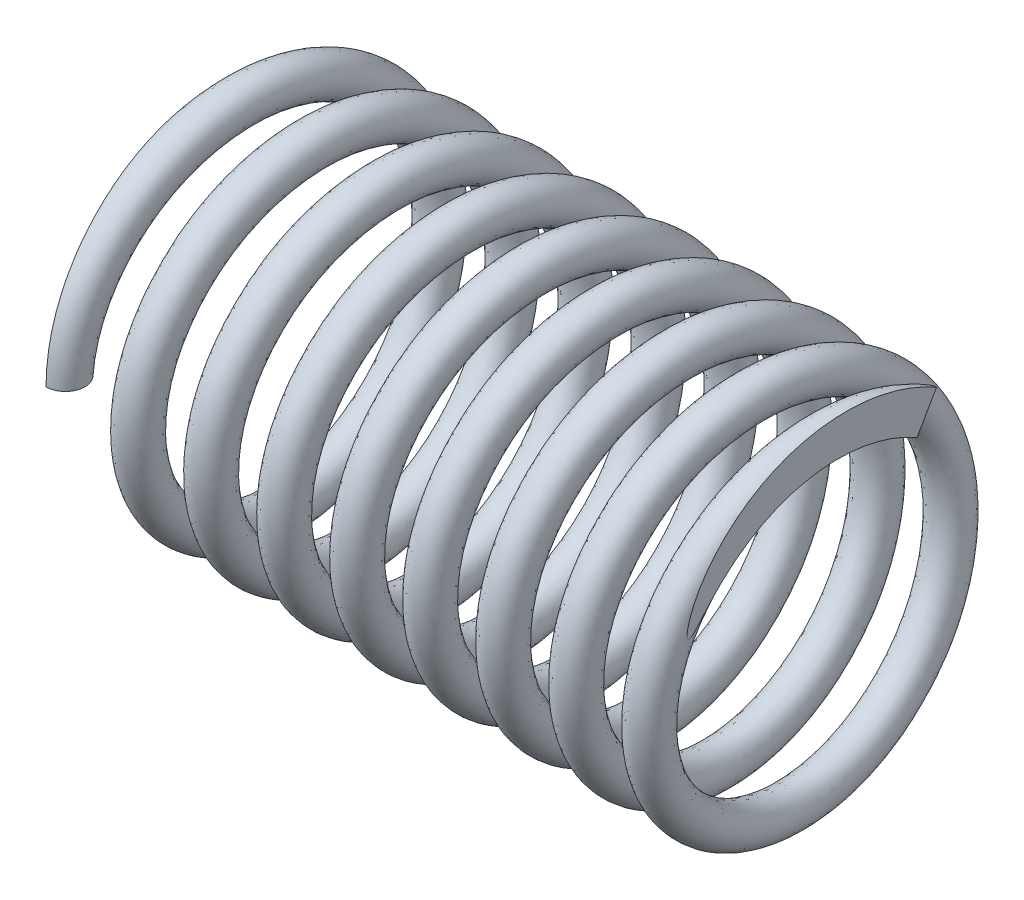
ISO-10303-21;
HEADER;
FILE_DESCRIPTION(('STEP AP214'),'2;1');
FILE_NAME('part.step','',(''),(''),'','','');
FILE_SCHEMA(('AUTOMOTIVE_DESIGN { 1 0 10303 214 1 1 1 1 }'));
ENDSEC;
DATA;
#1=APPLICATION_CONTEXT('core data for automotive mechanical design processes');
#2=APPLICATION_PROTOCOL_DEFINITION('international standard','automotive_design',2000,#1);
#3=PRODUCT_CONTEXT('',#1,'mechanical');
#4=PRODUCT('Part','Part','',(#3));
#5=PRODUCT_RELATED_PRODUCT_CATEGORY('part','',(#4));
#6=PRODUCT_DEFINITION_FORMATION('','',#4);
#7=PRODUCT_DEFINITION_CONTEXT('part definition',#1,'design');
#8=PRODUCT_DEFINITION('design','',#6,#7);
#9=PRODUCT_DEFINITION_SHAPE('','',#8);
#10=(LENGTH_UNIT() NAMED_UNIT(*) SI_UNIT(.MILLI.,.METRE.));
#11=(NAMED_UNIT(*) PLANE_ANGLE_UNIT() SI_UNIT($,.RADIAN.));
#12=(NAMED_UNIT(*) SI_UNIT($,.STERADIAN.) SOLID_ANGLE_UNIT());
#13=UNCERTAINTY_MEASURE_WITH_UNIT(LENGTH_MEASURE(1.E-05),#10,'distance_accuracy_value','');
#14=(GEOMETRIC_REPRESENTATION_CONTEXT(3) GLOBAL_UNCERTAINTY_ASSIGNED_CONTEXT((#13)) GLOBAL_UNIT_ASSIGNED_CONTEXT((#10,
#11,#12)) REPRESENTATION_CONTEXT('',''));
#15=CARTESIAN_POINT('',(0.,0.,0.));
#16=DIRECTION('',(0.,0.,1.));
#17=DIRECTION('',(1.,0.,0.));
#18=AXIS2_PLACEMENT_3D('',#15,#16,#17);
#19=CARTESIAN_POINT('',(12.7007380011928,2.69463804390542,-1.55574999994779));
#20=DIRECTION('',(0.,0.499999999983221,0.866025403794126));
#21=DIRECTION('',(0.,-0.866025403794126,0.499999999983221));
#22=AXIS2_PLACEMENT_3D('',#19,#20,#21);
#23=PLANE('',#22);
#24=DIRECTION('',(0.,0.866025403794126,-0.499999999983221));
#25=VECTOR('',#24,1.);
#26=CARTESIAN_POINT('',(12.7,2.69463804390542,-1.55574999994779));
#27=LINE('',#26,#25);
#28=CARTESIAN_POINT('',(12.7,2.69463862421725,-1.55575033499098));
#29=VERTEX_POINT('',#28);
#30=CARTESIAN_POINT('',(12.6999999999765,3.39854292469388,-1.96214967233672));
#31=VERTEX_POINT('',#30);
#32=EDGE_CURVE('E50',#29,#31,#27,.T.);
#33=ORIENTED_EDGE('',*,*,#32,.F.);
#34=CARTESIAN_POINT('',(12.7007380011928,3.04659076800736,-1.75894999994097));
#35=DIRECTION('',(0.,0.499999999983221,0.866025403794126));
#36=DIRECTION('',(0.,0.866025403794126,-0.499999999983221));
#37=AXIS2_PLACEMENT_3D('',#34,#35,#36);
#38=CIRCLE('',#37,0.4064);
#39=EDGE_CURVE('E37',#31,#29,#38,.T.);
#40=ORIENTED_EDGE('',*,*,#39,.F.);
#41=EDGE_LOOP('',(#33,#40));
#42=FACE_BOUND('',#41,.T.);
#43=ADVANCED_FACE('F33',(#42),#23,.F.);
#44=CARTESIAN_POINT('',(0.,0.,3.9243));
#45=CARTESIAN_POINT('',(0.09525,1.62549828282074,3.9243));
#46=CARTESIAN_POINT('',(0.1905,2.77489914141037,2.77489914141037));
#47=CARTESIAN_POINT('',(0.28575,3.9243,1.62549828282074));
#48=CARTESIAN_POINT('',(0.381,3.9243,0.));
#49=CARTESIAN_POINT('',(0.47625,3.9243,-1.62549828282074));
#50=CARTESIAN_POINT('',(0.5715,2.77489914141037,-2.77489914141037));
#51=CARTESIAN_POINT('',(0.66675,1.62549828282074,-3.9243));
#52=CARTESIAN_POINT('',(0.762,0.,-3.9243));
#53=CARTESIAN_POINT('',(0.85725,-1.62549828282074,-3.9243));
#54=CARTESIAN_POINT('',(0.9525,-2.77489914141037,-2.77489914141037));
#55=CARTESIAN_POINT('',(1.04775,-3.9243,-1.62549828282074));
#56=CARTESIAN_POINT('',(1.143,-3.9243,0.));
#57=CARTESIAN_POINT('',(1.23825,-3.9243,1.62549828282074));
#58=CARTESIAN_POINT('',(1.3335,-2.77489914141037,2.77489914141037));
#59=CARTESIAN_POINT('',(1.42875,-1.62549828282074,3.9243));
#60=CARTESIAN_POINT('',(1.524,0.,3.9243));
#61=CARTESIAN_POINT('',(1.61925,1.62549828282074,3.9243));
#62=CARTESIAN_POINT('',(1.7145,2.77489914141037,2.77489914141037));
#63=CARTESIAN_POINT('',(1.80975,3.9243,1.62549828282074));
#64=CARTESIAN_POINT('',(1.905,3.9243,0.));
#65=CARTESIAN_POINT('',(2.00025,3.9243,-1.62549828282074));
#66=CARTESIAN_POINT('',(2.0955,2.77489914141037,-2.77489914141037));
#67=CARTESIAN_POINT('',(2.19075,1.62549828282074,-3.9243));
#68=CARTESIAN_POINT('',(2.286,0.,-3.9243));
#69=CARTESIAN_POINT('',(2.38125,-1.62549828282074,-3.9243));
#70=CARTESIAN_POINT('',(2.4765,-2.77489914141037,-2.77489914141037));
#71=CARTESIAN_POINT('',(2.57175,-3.9243,-1.62549828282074));
#72=CARTESIAN_POINT('',(2.667,-3.9243,0.));
#73=CARTESIAN_POINT('',(2.76225,-3.9243,1.62549828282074));
#74=CARTESIAN_POINT('',(2.8575,-2.77489914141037,2.77489914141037));
#75=CARTESIAN_POINT('',(2.95275,-1.62549828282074,3.9243));
#76=CARTESIAN_POINT('',(3.048,0.,3.9243));
#77=CARTESIAN_POINT('',(3.14325,1.62549828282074,3.9243));
#78=CARTESIAN_POINT('',(3.2385,2.77489914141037,2.77489914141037));
#79=CARTESIAN_POINT('',(3.33375,3.9243,1.62549828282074));
#80=CARTESIAN_POINT('',(3.429,3.9243,0.));
#81=CARTESIAN_POINT('',(3.52425,3.9243,-1.62549828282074));
#82=CARTESIAN_POINT('',(3.6195,2.77489914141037,-2.77489914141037));
#83=CARTESIAN_POINT('',(3.71475,1.62549828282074,-3.9243));
#84=CARTESIAN_POINT('',(3.81,0.,-3.9243));
#85=CARTESIAN_POINT('',(3.90525,-1.62549828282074,-3.9243));
#86=CARTESIAN_POINT('',(4.0005,-2.77489914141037,-2.77489914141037));
#87=CARTESIAN_POINT('',(4.09575,-3.9243,-1.62549828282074));
#88=CARTESIAN_POINT('',(4.191,-3.9243,0.));
#89=CARTESIAN_POINT('',(4.28625,-3.9243,1.62549828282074));
#90=CARTESIAN_POINT('',(4.3815,-2.77489914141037,2.77489914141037));
#91=CARTESIAN_POINT('',(4.47675,-1.62549828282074,3.9243));
#92=CARTESIAN_POINT('',(4.572,0.,3.9243));
#93=CARTESIAN_POINT('',(4.66725,1.62549828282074,3.9243));
#94=CARTESIAN_POINT('',(4.7625,2.77489914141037,2.77489914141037));
#95=CARTESIAN_POINT('',(4.85775,3.9243,1.62549828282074));
#96=CARTESIAN_POINT('',(4.953,3.9243,0.));
#97=CARTESIAN_POINT('',(5.04825,3.9243,-1.62549828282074));
#98=CARTESIAN_POINT('',(5.1435,2.77489914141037,-2.77489914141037));
#99=CARTESIAN_POINT('',(5.23875,1.62549828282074,-3.9243));
#100=CARTESIAN_POINT('',(5.334,0.,-3.9243));
#101=CARTESIAN_POINT('',(5.42925,-1.62549828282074,-3.9243));
#102=CARTESIAN_POINT('',(5.5245,-2.77489914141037,-2.77489914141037));
#103=CARTESIAN_POINT('',(5.61975,-3.9243,-1.62549828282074));
#104=CARTESIAN_POINT('',(5.715,-3.9243,0.));
#105=CARTESIAN_POINT('',(5.81025,-3.9243,1.62549828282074));
#106=CARTESIAN_POINT('',(5.9055,-2.77489914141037,2.77489914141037));
#107=CARTESIAN_POINT('',(6.00075,-1.62549828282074,3.9243));
#108=CARTESIAN_POINT('',(6.096,0.,3.9243));
#109=CARTESIAN_POINT('',(6.19125,1.62549828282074,3.9243));
#110=CARTESIAN_POINT('',(6.2865,2.77489914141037,2.77489914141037));
#111=CARTESIAN_POINT('',(6.38175,3.9243,1.62549828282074));
#112=CARTESIAN_POINT('',(6.477,3.9243,0.));
#113=CARTESIAN_POINT('',(6.57225,3.9243,-1.62549828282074));
#114=CARTESIAN_POINT('',(6.6675,2.77489914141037,-2.77489914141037));
#115=CARTESIAN_POINT('',(6.76275,1.62549828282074,-3.9243));
#116=CARTESIAN_POINT('',(6.858,0.,-3.9243));
#117=CARTESIAN_POINT('',(6.95325,-1.62549828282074,-3.9243));
#118=CARTESIAN_POINT('',(7.0485,-2.77489914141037,-2.77489914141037));
#119=CARTESIAN_POINT('',(7.14375,-3.9243,-1.62549828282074));
#120=CARTESIAN_POINT('',(7.239,-3.9243,0.));
#121=CARTESIAN_POINT('',(7.33425,-3.9243,1.62549828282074));
#122=CARTESIAN_POINT('',(7.4295,-2.77489914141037,2.77489914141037));
#123=CARTESIAN_POINT('',(7.52475,-1.62549828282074,3.9243));
#124=CARTESIAN_POINT('',(7.62,0.,3.9243));
#125=CARTESIAN_POINT('',(7.71525,1.62549828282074,3.9243));
#126=CARTESIAN_POINT('',(7.8105,2.77489914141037,2.77489914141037));
#127=CARTESIAN_POINT('',(7.90575,3.9243,1.62549828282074));
#128=CARTESIAN_POINT('',(8.001,3.9243,0.));
#129=CARTESIAN_POINT('',(8.09625,3.9243,-1.62549828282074));
#130=CARTESIAN_POINT('',(8.1915,2.77489914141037,-2.77489914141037));
#131=CARTESIAN_POINT('',(8.28675,1.62549828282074,-3.9243));
#132=CARTESIAN_POINT('',(8.382,0.,-3.9243));
#133=CARTESIAN_POINT('',(8.47725,-1.62549828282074,-3.9243));
#134=CARTESIAN_POINT('',(8.5725,-2.77489914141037,-2.77489914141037));
#135=CARTESIAN_POINT('',(8.66775,-3.9243,-1.62549828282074));
#136=CARTESIAN_POINT('',(8.763,-3.9243,0.));
#137=CARTESIAN_POINT('',(8.85825,-3.9243,1.62549828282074));
#138=CARTESIAN_POINT('',(8.9535,-2.77489914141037,2.77489914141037));
#139=CARTESIAN_POINT('',(9.04875,-1.62549828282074,3.9243));
#140=CARTESIAN_POINT('',(9.144,0.,3.9243));
#141=CARTESIAN_POINT('',(9.23925,1.62549828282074,3.9243));
#142=CARTESIAN_POINT('',(9.3345,2.77489914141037,2.77489914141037));
#143=CARTESIAN_POINT('',(9.42975,3.9243,1.62549828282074));
#144=CARTESIAN_POINT('',(9.525,3.9243,0.));
#145=CARTESIAN_POINT('',(9.62025,3.9243,-1.62549828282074));
#146=CARTESIAN_POINT('',(9.7155,2.77489914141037,-2.77489914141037));
#147=CARTESIAN_POINT('',(9.81075,1.62549828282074,-3.9243));
#148=CARTESIAN_POINT('',(9.906,0.,-3.9243));
#149=CARTESIAN_POINT('',(10.00125,-1.62549828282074,-3.9243));
#150=CARTESIAN_POINT('',(10.0965,-2.77489914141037,-2.77489914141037));
#151=CARTESIAN_POINT('',(10.19175,-3.9243,-1.62549828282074));
#152=CARTESIAN_POINT('',(10.287,-3.9243,0.));
#153=CARTESIAN_POINT('',(10.38225,-3.9243,1.62549828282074));
#154=CARTESIAN_POINT('',(10.4775,-2.77489914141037,2.77489914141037));
#155=CARTESIAN_POINT('',(10.57275,-1.62549828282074,3.9243));
#156=CARTESIAN_POINT('',(10.668,0.,3.9243));
#157=CARTESIAN_POINT('',(10.76325,1.62549828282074,3.9243));
#158=CARTESIAN_POINT('',(10.8585,2.77489914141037,2.77489914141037));
#159=CARTESIAN_POINT('',(10.95375,3.9243,1.62549828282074));
#160=CARTESIAN_POINT('',(11.049,3.9243,0.));
#161=CARTESIAN_POINT('',(11.14425,3.9243,-1.62549828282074));
#162=CARTESIAN_POINT('',(11.2395,2.77489914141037,-2.77489914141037));
#163=CARTESIAN_POINT('',(11.33475,1.62549828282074,-3.9243));
#164=CARTESIAN_POINT('',(11.43,0.,-3.9243));
#165=CARTESIAN_POINT('',(11.52525,-1.62549828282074,-3.9243));
#166=CARTESIAN_POINT('',(11.6205,-2.77489914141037,-2.77489914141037));
#167=CARTESIAN_POINT('',(11.71575,-3.9243,-1.62549828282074));
#168=CARTESIAN_POINT('',(11.811,-3.9243,0.));
#169=CARTESIAN_POINT('',(11.90625,-3.9243,1.62549828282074));
#170=CARTESIAN_POINT('',(12.0015,-2.77489914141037,2.77489914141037));
#171=CARTESIAN_POINT('',(12.09675,-1.62549828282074,3.9243));
#172=CARTESIAN_POINT('',(12.192,0.,3.9243));
#173=CARTESIAN_POINT('',(12.28725,1.62549828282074,3.9243));
#174=CARTESIAN_POINT('',(12.3825,2.77489914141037,2.77489914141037));
#175=CARTESIAN_POINT('',(12.47775,3.9243,1.62549828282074));
#176=CARTESIAN_POINT('',(12.573,3.9243,0.));
#177=CARTESIAN_POINT('',(12.6346159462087,3.9243,-1.05151301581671));
#178=CARTESIAN_POINT('',(12.7007380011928,3.39854349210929,-1.96214999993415));
#179=CARTESIAN_POINT('',(0.8128,0.,3.9243));
#180=CARTESIAN_POINT('',(0.90805,1.62549828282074,3.9243));
#181=CARTESIAN_POINT('',(1.0033,2.77489914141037,2.77489914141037));
#182=CARTESIAN_POINT('',(1.09855,3.9243,1.62549828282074));
#183=CARTESIAN_POINT('',(1.1938,3.9243,0.));
#184=CARTESIAN_POINT('',(1.28905,3.9243,-1.62549828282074));
#185=CARTESIAN_POINT('',(1.3843,2.77489914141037,-2.77489914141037));
#186=CARTESIAN_POINT('',(1.47955,1.62549828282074,-3.9243));
#187=CARTESIAN_POINT('',(1.5748,0.,-3.9243));
#188=CARTESIAN_POINT('',(1.67005,-1.62549828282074,-3.9243));
#189=CARTESIAN_POINT('',(1.7653,-2.77489914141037,-2.77489914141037));
#190=CARTESIAN_POINT('',(1.86055,-3.9243,-1.62549828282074));
#191=CARTESIAN_POINT('',(1.9558,-3.9243,0.));
#192=CARTESIAN_POINT('',(2.05105,-3.9243,1.62549828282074));
#193=CARTESIAN_POINT('',(2.1463,-2.77489914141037,2.77489914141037));
#194=CARTESIAN_POINT('',(2.24155,-1.62549828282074,3.9243));
#195=CARTESIAN_POINT('',(2.3368,0.,3.9243));
#196=CARTESIAN_POINT('',(2.43205,1.62549828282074,3.9243));
#197=CARTESIAN_POINT('',(2.5273,2.77489914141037,2.77489914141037));
#198=CARTESIAN_POINT('',(2.62255,3.9243,1.62549828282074));
#199=CARTESIAN_POINT('',(2.7178,3.9243,0.));
#200=CARTESIAN_POINT('',(2.81305,3.9243,-1.62549828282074));
#201=CARTESIAN_POINT('',(2.9083,2.77489914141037,-2.77489914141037));
#202=CARTESIAN_POINT('',(3.00355,1.62549828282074,-3.9243));
#203=CARTESIAN_POINT('',(3.0988,0.,-3.9243));
#204=CARTESIAN_POINT('',(3.19405,-1.62549828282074,-3.9243));
#205=CARTESIAN_POINT('',(3.2893,-2.77489914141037,-2.77489914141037));
#206=CARTESIAN_POINT('',(3.38455,-3.9243,-1.62549828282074));
#207=CARTESIAN_POINT('',(3.4798,-3.9243,0.));
#208=CARTESIAN_POINT('',(3.57505,-3.9243,1.62549828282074));
#209=CARTESIAN_POINT('',(3.6703,-2.77489914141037,2.77489914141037));
#210=CARTESIAN_POINT('',(3.76555,-1.62549828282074,3.9243));
#211=CARTESIAN_POINT('',(3.8608,0.,3.9243));
#212=CARTESIAN_POINT('',(3.95605,1.62549828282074,3.9243));
#213=CARTESIAN_POINT('',(4.0513,2.77489914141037,2.77489914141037));
#214=CARTESIAN_POINT('',(4.14655,3.9243,1.62549828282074));
#215=CARTESIAN_POINT('',(4.2418,3.9243,0.));
#216=CARTESIAN_POINT('',(4.33705,3.9243,-1.62549828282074));
#217=CARTESIAN_POINT('',(4.4323,2.77489914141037,-2.77489914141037));
#218=CARTESIAN_POINT('',(4.52755,1.62549828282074,-3.9243));
#219=CARTESIAN_POINT('',(4.6228,0.,-3.9243));
#220=CARTESIAN_POINT('',(4.71805,-1.62549828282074,-3.9243));
#221=CARTESIAN_POINT('',(4.8133,-2.77489914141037,-2.77489914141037));
#222=CARTESIAN_POINT('',(4.90855,-3.9243,-1.62549828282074));
#223=CARTESIAN_POINT('',(5.0038,-3.9243,0.));
#224=CARTESIAN_POINT('',(5.09905,-3.9243,1.62549828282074));
#225=CARTESIAN_POINT('',(5.1943,-2.77489914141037,2.77489914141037));
#226=CARTESIAN_POINT('',(5.28955,-1.62549828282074,3.9243));
#227=CARTESIAN_POINT('',(5.3848,0.,3.9243));
#228=CARTESIAN_POINT('',(5.48005,1.62549828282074,3.9243));
#229=CARTESIAN_POINT('',(5.5753,2.77489914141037,2.77489914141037));
#230=CARTESIAN_POINT('',(5.67055,3.9243,1.62549828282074));
#231=CARTESIAN_POINT('',(5.7658,3.9243,0.));
#232=CARTESIAN_POINT('',(5.86105,3.9243,-1.62549828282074));
#233=CARTESIAN_POINT('',(5.9563,2.77489914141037,-2.77489914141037));
#234=CARTESIAN_POINT('',(6.05155,1.62549828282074,-3.9243));
#235=CARTESIAN_POINT('',(6.1468,0.,-3.9243));
#236=CARTESIAN_POINT('',(6.24205,-1.62549828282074,-3.9243));
#237=CARTESIAN_POINT('',(6.3373,-2.77489914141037,-2.77489914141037));
#238=CARTESIAN_POINT('',(6.43255,-3.9243,-1.62549828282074));
#239=CARTESIAN_POINT('',(6.5278,-3.9243,0.));
#240=CARTESIAN_POINT('',(6.62305,-3.9243,1.62549828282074));
#241=CARTESIAN_POINT('',(6.7183,-2.77489914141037,2.77489914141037));
#242=CARTESIAN_POINT('',(6.81355,-1.62549828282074,3.9243));
#243=CARTESIAN_POINT('',(6.9088,0.,3.9243));
#244=CARTESIAN_POINT('',(7.00405,1.62549828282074,3.9243));
#245=CARTESIAN_POINT('',(7.0993,2.77489914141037,2.77489914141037));
#246=CARTESIAN_POINT('',(7.19455,3.9243,1.62549828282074));
#247=CARTESIAN_POINT('',(7.2898,3.9243,0.));
#248=CARTESIAN_POINT('',(7.38505,3.9243,-1.62549828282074));
#249=CARTESIAN_POINT('',(7.4803,2.77489914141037,-2.77489914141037));
#250=CARTESIAN_POINT('',(7.57555,1.62549828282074,-3.9243));
#251=CARTESIAN_POINT('',(7.6708,0.,-3.9243));
#252=CARTESIAN_POINT('',(7.76605,-1.62549828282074,-3.9243));
#253=CARTESIAN_POINT('',(7.8613,-2.77489914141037,-2.77489914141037));
#254=CARTESIAN_POINT('',(7.95655,-3.9243,-1.62549828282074));
#255=CARTESIAN_POINT('',(8.0518,-3.9243,0.));
#256=CARTESIAN_POINT('',(8.14705,-3.9243,1.62549828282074));
#257=CARTESIAN_POINT('',(8.2423,-2.77489914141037,2.77489914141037));
#258=CARTESIAN_POINT('',(8.33755,-1.62549828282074,3.9243));
#259=CARTESIAN_POINT('',(8.4328,0.,3.9243));
#260=CARTESIAN_POINT('',(8.52805,1.62549828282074,3.9243));
#261=CARTESIAN_POINT('',(8.6233,2.77489914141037,2.77489914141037));
#262=CARTESIAN_POINT('',(8.71855,3.9243,1.62549828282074));
#263=CARTESIAN_POINT('',(8.8138,3.9243,0.));
#264=CARTESIAN_POINT('',(8.90905,3.9243,-1.62549828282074));
#265=CARTESIAN_POINT('',(9.0043,2.77489914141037,-2.77489914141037));
#266=CARTESIAN_POINT('',(9.09955,1.62549828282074,-3.9243));
#267=CARTESIAN_POINT('',(9.1948,0.,-3.9243));
#268=CARTESIAN_POINT('',(9.29005,-1.62549828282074,-3.9243));
#269=CARTESIAN_POINT('',(9.3853,-2.77489914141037,-2.77489914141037));
#270=CARTESIAN_POINT('',(9.48055,-3.9243,-1.62549828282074));
#271=CARTESIAN_POINT('',(9.5758,-3.9243,0.));
#272=CARTESIAN_POINT('',(9.67105,-3.9243,1.62549828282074));
#273=CARTESIAN_POINT('',(9.7663,-2.77489914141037,2.77489914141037));
#274=CARTESIAN_POINT('',(9.86155,-1.62549828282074,3.9243));
#275=CARTESIAN_POINT('',(9.9568,0.,3.9243));
#276=CARTESIAN_POINT('',(10.05205,1.62549828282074,3.9243));
#277=CARTESIAN_POINT('',(10.1473,2.77489914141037,2.77489914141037));
#278=CARTESIAN_POINT('',(10.24255,3.9243,1.62549828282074));
#279=CARTESIAN_POINT('',(10.3378,3.9243,0.));
#280=CARTESIAN_POINT('',(10.43305,3.9243,-1.62549828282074));
#281=CARTESIAN_POINT('',(10.5283,2.77489914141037,-2.77489914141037));
#282=CARTESIAN_POINT('',(10.62355,1.62549828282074,-3.9243));
#283=CARTESIAN_POINT('',(10.7188,0.,-3.9243));
#284=CARTESIAN_POINT('',(10.81405,-1.62549828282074,-3.9243));
#285=CARTESIAN_POINT('',(10.9093,-2.77489914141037,-2.77489914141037));
#286=CARTESIAN_POINT('',(11.00455,-3.9243,-1.62549828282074));
#287=CARTESIAN_POINT('',(11.0998,-3.9243,0.));
#288=CARTESIAN_POINT('',(11.19505,-3.9243,1.62549828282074));
#289=CARTESIAN_POINT('',(11.2903,-2.77489914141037,2.77489914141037));
#290=CARTESIAN_POINT('',(11.38555,-1.62549828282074,3.9243));
#291=CARTESIAN_POINT('',(11.4808,0.,3.9243));
#292=CARTESIAN_POINT('',(11.57605,1.62549828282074,3.9243));
#293=CARTESIAN_POINT('',(11.6713,2.77489914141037,2.77489914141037));
#294=CARTESIAN_POINT('',(11.76655,3.9243,1.62549828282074));
#295=CARTESIAN_POINT('',(11.8618,3.9243,0.));
#296=CARTESIAN_POINT('',(11.95705,3.9243,-1.62549828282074));
#297=CARTESIAN_POINT('',(12.0523,2.77489914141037,-2.77489914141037));
#298=CARTESIAN_POINT('',(12.14755,1.62549828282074,-3.9243));
#299=CARTESIAN_POINT('',(12.2428,0.,-3.9243));
#300=CARTESIAN_POINT('',(12.33805,-1.62549828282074,-3.9243));
#301=CARTESIAN_POINT('',(12.4333,-2.77489914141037,-2.77489914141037));
#302=CARTESIAN_POINT('',(12.52855,-3.9243,-1.62549828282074));
#303=CARTESIAN_POINT('',(12.6238,-3.9243,0.));
#304=CARTESIAN_POINT('',(12.71905,-3.9243,1.62549828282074));
#305=CARTESIAN_POINT('',(12.8143,-2.77489914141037,2.77489914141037));
#306=CARTESIAN_POINT('',(12.90955,-1.62549828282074,3.9243));
#307=CARTESIAN_POINT('',(13.0048,0.,3.9243));
#308=CARTESIAN_POINT('',(13.10005,1.62549828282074,3.9243));
#309=CARTESIAN_POINT('',(13.1953,2.77489914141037,2.77489914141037));
#310=CARTESIAN_POINT('',(13.29055,3.9243,1.62549828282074));
#311=CARTESIAN_POINT('',(13.3858,3.9243,0.));
#312=CARTESIAN_POINT('',(13.4474159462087,3.9243,-1.05151301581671));
#313=CARTESIAN_POINT('',(13.5135380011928,3.39854349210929,-1.96214999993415));
#314=CARTESIAN_POINT('',(0.8128,0.,3.1115));
#315=CARTESIAN_POINT('',(0.90805,1.28882549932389,3.1115));
#316=CARTESIAN_POINT('',(1.0033,2.20016274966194,2.20016274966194));
#317=CARTESIAN_POINT('',(1.09855,3.1115,1.28882549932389));
#318=CARTESIAN_POINT('',(1.1938,3.1115,0.));
#319=CARTESIAN_POINT('',(1.28905,3.1115,-1.28882549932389));
#320=CARTESIAN_POINT('',(1.3843,2.20016274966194,-2.20016274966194));
#321=CARTESIAN_POINT('',(1.47955,1.28882549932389,-3.1115));
#322=CARTESIAN_POINT('',(1.5748,0.,-3.1115));
#323=CARTESIAN_POINT('',(1.67005,-1.28882549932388,-3.1115));
#324=CARTESIAN_POINT('',(1.7653,-2.20016274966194,-2.20016274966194));
#325=CARTESIAN_POINT('',(1.86055,-3.1115,-1.28882549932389));
#326=CARTESIAN_POINT('',(1.9558,-3.1115,0.));
#327=CARTESIAN_POINT('',(2.05105,-3.1115,1.28882549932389));
#328=CARTESIAN_POINT('',(2.1463,-2.20016274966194,2.20016274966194));
#329=CARTESIAN_POINT('',(2.24155,-1.28882549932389,3.1115));
#330=CARTESIAN_POINT('',(2.3368,0.,3.1115));
#331=CARTESIAN_POINT('',(2.43205,1.28882549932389,3.1115));
#332=CARTESIAN_POINT('',(2.5273,2.20016274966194,2.20016274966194));
#333=CARTESIAN_POINT('',(2.62255,3.1115,1.28882549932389));
#334=CARTESIAN_POINT('',(2.7178,3.1115,0.));
#335=CARTESIAN_POINT('',(2.81305,3.1115,-1.28882549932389));
#336=CARTESIAN_POINT('',(2.9083,2.20016274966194,-2.20016274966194));
#337=CARTESIAN_POINT('',(3.00355,1.28882549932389,-3.1115));
#338=CARTESIAN_POINT('',(3.0988,0.,-3.1115));
#339=CARTESIAN_POINT('',(3.19405,-1.28882549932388,-3.1115));
#340=CARTESIAN_POINT('',(3.2893,-2.20016274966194,-2.20016274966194));
#341=CARTESIAN_POINT('',(3.38455,-3.1115,-1.28882549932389));
#342=CARTESIAN_POINT('',(3.4798,-3.1115,0.));
#343=CARTESIAN_POINT('',(3.57505,-3.1115,1.28882549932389));
#344=CARTESIAN_POINT('',(3.6703,-2.20016274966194,2.20016274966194));
#345=CARTESIAN_POINT('',(3.76555,-1.28882549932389,3.1115));
#346=CARTESIAN_POINT('',(3.8608,0.,3.1115));
#347=CARTESIAN_POINT('',(3.95605,1.28882549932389,3.1115));
#348=CARTESIAN_POINT('',(4.0513,2.20016274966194,2.20016274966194));
#349=CARTESIAN_POINT('',(4.14655,3.1115,1.28882549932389));
#350=CARTESIAN_POINT('',(4.2418,3.1115,0.));
#351=CARTESIAN_POINT('',(4.33705,3.1115,-1.28882549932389));
#352=CARTESIAN_POINT('',(4.4323,2.20016274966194,-2.20016274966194));
#353=CARTESIAN_POINT('',(4.52755,1.28882549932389,-3.1115));
#354=CARTESIAN_POINT('',(4.6228,0.,-3.1115));
#355=CARTESIAN_POINT('',(4.71805,-1.28882549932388,-3.1115));
#356=CARTESIAN_POINT('',(4.8133,-2.20016274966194,-2.20016274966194));
#357=CARTESIAN_POINT('',(4.90855,-3.1115,-1.28882549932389));
#358=CARTESIAN_POINT('',(5.0038,-3.1115,0.));
#359=CARTESIAN_POINT('',(5.09905,-3.1115,1.28882549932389));
#360=CARTESIAN_POINT('',(5.1943,-2.20016274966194,2.20016274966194));
#361=CARTESIAN_POINT('',(5.28955,-1.28882549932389,3.1115));
#362=CARTESIAN_POINT('',(5.3848,0.,3.1115));
#363=CARTESIAN_POINT('',(5.48005,1.28882549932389,3.1115));
#364=CARTESIAN_POINT('',(5.5753,2.20016274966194,2.20016274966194));
#365=CARTESIAN_POINT('',(5.67055,3.1115,1.28882549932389));
#366=CARTESIAN_POINT('',(5.7658,3.1115,0.));
#367=CARTESIAN_POINT('',(5.86105,3.1115,-1.28882549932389));
#368=CARTESIAN_POINT('',(5.9563,2.20016274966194,-2.20016274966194));
#369=CARTESIAN_POINT('',(6.05155,1.28882549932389,-3.1115));
#370=CARTESIAN_POINT('',(6.1468,0.,-3.1115));
#371=CARTESIAN_POINT('',(6.24205,-1.28882549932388,-3.1115));
#372=CARTESIAN_POINT('',(6.3373,-2.20016274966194,-2.20016274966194));
#373=CARTESIAN_POINT('',(6.43255,-3.1115,-1.28882549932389));
#374=CARTESIAN_POINT('',(6.5278,-3.1115,0.));
#375=CARTESIAN_POINT('',(6.62305,-3.1115,1.28882549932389));
#376=CARTESIAN_POINT('',(6.7183,-2.20016274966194,2.20016274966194));
#377=CARTESIAN_POINT('',(6.81355,-1.28882549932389,3.1115));
#378=CARTESIAN_POINT('',(6.9088,0.,3.1115));
#379=CARTESIAN_POINT('',(7.00405,1.28882549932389,3.1115));
#380=CARTESIAN_POINT('',(7.0993,2.20016274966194,2.20016274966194));
#381=CARTESIAN_POINT('',(7.19455,3.1115,1.28882549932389));
#382=CARTESIAN_POINT('',(7.2898,3.1115,0.));
#383=CARTESIAN_POINT('',(7.38505,3.1115,-1.28882549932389));
#384=CARTESIAN_POINT('',(7.4803,2.20016274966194,-2.20016274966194));
#385=CARTESIAN_POINT('',(7.57555,1.28882549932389,-3.1115));
#386=CARTESIAN_POINT('',(7.6708,0.,-3.1115));
#387=CARTESIAN_POINT('',(7.76605,-1.28882549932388,-3.1115));
#388=CARTESIAN_POINT('',(7.8613,-2.20016274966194,-2.20016274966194));
#389=CARTESIAN_POINT('',(7.95655,-3.1115,-1.28882549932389));
#390=CARTESIAN_POINT('',(8.0518,-3.1115,0.));
#391=CARTESIAN_POINT('',(8.14705,-3.1115,1.28882549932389));
#392=CARTESIAN_POINT('',(8.2423,-2.20016274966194,2.20016274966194));
#393=CARTESIAN_POINT('',(8.33755,-1.28882549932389,3.1115));
#394=CARTESIAN_POINT('',(8.4328,0.,3.1115));
#395=CARTESIAN_POINT('',(8.52805,1.28882549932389,3.1115));
#396=CARTESIAN_POINT('',(8.6233,2.20016274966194,2.20016274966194));
#397=CARTESIAN_POINT('',(8.71855,3.1115,1.28882549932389));
#398=CARTESIAN_POINT('',(8.8138,3.1115,0.));
#399=CARTESIAN_POINT('',(8.90905,3.1115,-1.28882549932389));
#400=CARTESIAN_POINT('',(9.0043,2.20016274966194,-2.20016274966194));
#401=CARTESIAN_POINT('',(9.09955,1.28882549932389,-3.1115));
#402=CARTESIAN_POINT('',(9.1948,0.,-3.1115));
#403=CARTESIAN_POINT('',(9.29005,-1.28882549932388,-3.1115));
#404=CARTESIAN_POINT('',(9.3853,-2.20016274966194,-2.20016274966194));
#405=CARTESIAN_POINT('',(9.48055,-3.1115,-1.28882549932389));
#406=CARTESIAN_POINT('',(9.5758,-3.1115,0.));
#407=CARTESIAN_POINT('',(9.67105,-3.1115,1.28882549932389));
#408=CARTESIAN_POINT('',(9.7663,-2.20016274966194,2.20016274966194));
#409=CARTESIAN_POINT('',(9.86155,-1.28882549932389,3.1115));
#410=CARTESIAN_POINT('',(9.9568,0.,3.1115));
#411=CARTESIAN_POINT('',(10.05205,1.28882549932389,3.1115));
#412=CARTESIAN_POINT('',(10.1473,2.20016274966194,2.20016274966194));
#413=CARTESIAN_POINT('',(10.24255,3.1115,1.28882549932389));
#414=CARTESIAN_POINT('',(10.3378,3.1115,0.));
#415=CARTESIAN_POINT('',(10.43305,3.1115,-1.28882549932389));
#416=CARTESIAN_POINT('',(10.5283,2.20016274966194,-2.20016274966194));
#417=CARTESIAN_POINT('',(10.62355,1.28882549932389,-3.1115));
#418=CARTESIAN_POINT('',(10.7188,0.,-3.1115));
#419=CARTESIAN_POINT('',(10.81405,-1.28882549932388,-3.1115));
#420=CARTESIAN_POINT('',(10.9093,-2.20016274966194,-2.20016274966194));
#421=CARTESIAN_POINT('',(11.00455,-3.1115,-1.28882549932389));
#422=CARTESIAN_POINT('',(11.0998,-3.1115,0.));
#423=CARTESIAN_POINT('',(11.19505,-3.1115,1.28882549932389));
#424=CARTESIAN_POINT('',(11.2903,-2.20016274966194,2.20016274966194));
#425=CARTESIAN_POINT('',(11.38555,-1.28882549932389,3.1115));
#426=CARTESIAN_POINT('',(11.4808,0.,3.1115));
#427=CARTESIAN_POINT('',(11.57605,1.28882549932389,3.1115));
#428=CARTESIAN_POINT('',(11.6713,2.20016274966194,2.20016274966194));
#429=CARTESIAN_POINT('',(11.76655,3.1115,1.28882549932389));
#430=CARTESIAN_POINT('',(11.8618,3.1115,0.));
#431=CARTESIAN_POINT('',(11.95705,3.1115,-1.28882549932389));
#432=CARTESIAN_POINT('',(12.0523,2.20016274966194,-2.20016274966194));
#433=CARTESIAN_POINT('',(12.14755,1.28882549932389,-3.1115));
#434=CARTESIAN_POINT('',(12.2428,0.,-3.1115));
#435=CARTESIAN_POINT('',(12.33805,-1.28882549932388,-3.1115));
#436=CARTESIAN_POINT('',(12.4333,-2.20016274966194,-2.20016274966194));
#437=CARTESIAN_POINT('',(12.52855,-3.1115,-1.28882549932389));
#438=CARTESIAN_POINT('',(12.6238,-3.1115,0.));
#439=CARTESIAN_POINT('',(12.71905,-3.1115,1.28882549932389));
#440=CARTESIAN_POINT('',(12.8143,-2.20016274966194,2.20016274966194));
#441=CARTESIAN_POINT('',(12.90955,-1.28882549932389,3.1115));
#442=CARTESIAN_POINT('',(13.0048,0.,3.1115));
#443=CARTESIAN_POINT('',(13.10005,1.28882549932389,3.1115));
#444=CARTESIAN_POINT('',(13.1953,2.20016274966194,2.20016274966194));
#445=CARTESIAN_POINT('',(13.29055,3.1115,1.28882549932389));
#446=CARTESIAN_POINT('',(13.3858,3.1115,0.));
#447=CARTESIAN_POINT('',(13.4474159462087,3.1115,-0.833723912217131));
#448=CARTESIAN_POINT('',(13.5135380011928,2.69463804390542,-1.55574999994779));
#449=CARTESIAN_POINT('',(0.,0.,3.1115));
#450=CARTESIAN_POINT('',(0.0952500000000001,1.28882549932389,3.1115));
#451=CARTESIAN_POINT('',(0.1905,2.20016274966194,2.20016274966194));
#452=CARTESIAN_POINT('',(0.28575,3.1115,1.28882549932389));
#453=CARTESIAN_POINT('',(0.381,3.1115,0.));
#454=CARTESIAN_POINT('',(0.47625,3.1115,-1.28882549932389));
#455=CARTESIAN_POINT('',(0.5715,2.20016274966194,-2.20016274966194));
#456=CARTESIAN_POINT('',(0.66675,1.28882549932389,-3.1115));
#457=CARTESIAN_POINT('',(0.762,0.,-3.1115));
#458=CARTESIAN_POINT('',(0.85725,-1.28882549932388,-3.1115));
#459=CARTESIAN_POINT('',(0.9525,-2.20016274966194,-2.20016274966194));
#460=CARTESIAN_POINT('',(1.04775,-3.1115,-1.28882549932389));
#461=CARTESIAN_POINT('',(1.143,-3.1115,0.));
#462=CARTESIAN_POINT('',(1.23825,-3.1115,1.28882549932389));
#463=CARTESIAN_POINT('',(1.3335,-2.20016274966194,2.20016274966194));
#464=CARTESIAN_POINT('',(1.42875,-1.28882549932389,3.1115));
#465=CARTESIAN_POINT('',(1.524,0.,3.1115));
#466=CARTESIAN_POINT('',(1.61925,1.28882549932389,3.1115));
#467=CARTESIAN_POINT('',(1.7145,2.20016274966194,2.20016274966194));
#468=CARTESIAN_POINT('',(1.80975,3.1115,1.28882549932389));
#469=CARTESIAN_POINT('',(1.905,3.1115,0.));
#470=CARTESIAN_POINT('',(2.00025,3.1115,-1.28882549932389));
#471=CARTESIAN_POINT('',(2.0955,2.20016274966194,-2.20016274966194));
#472=CARTESIAN_POINT('',(2.19075,1.28882549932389,-3.1115));
#473=CARTESIAN_POINT('',(2.286,0.,-3.1115));
#474=CARTESIAN_POINT('',(2.38125,-1.28882549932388,-3.1115));
#475=CARTESIAN_POINT('',(2.4765,-2.20016274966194,-2.20016274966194));
#476=CARTESIAN_POINT('',(2.57175,-3.1115,-1.28882549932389));
#477=CARTESIAN_POINT('',(2.667,-3.1115,0.));
#478=CARTESIAN_POINT('',(2.76225,-3.1115,1.28882549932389));
#479=CARTESIAN_POINT('',(2.8575,-2.20016274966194,2.20016274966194));
#480=CARTESIAN_POINT('',(2.95275,-1.28882549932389,3.1115));
#481=CARTESIAN_POINT('',(3.048,0.,3.1115));
#482=CARTESIAN_POINT('',(3.14325,1.28882549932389,3.1115));
#483=CARTESIAN_POINT('',(3.2385,2.20016274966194,2.20016274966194));
#484=CARTESIAN_POINT('',(3.33375,3.1115,1.28882549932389));
#485=CARTESIAN_POINT('',(3.429,3.1115,0.));
#486=CARTESIAN_POINT('',(3.52425,3.1115,-1.28882549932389));
#487=CARTESIAN_POINT('',(3.6195,2.20016274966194,-2.20016274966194));
#488=CARTESIAN_POINT('',(3.71475,1.28882549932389,-3.1115));
#489=CARTESIAN_POINT('',(3.81,0.,-3.1115));
#490=CARTESIAN_POINT('',(3.90525,-1.28882549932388,-3.1115));
#491=CARTESIAN_POINT('',(4.0005,-2.20016274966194,-2.20016274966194));
#492=CARTESIAN_POINT('',(4.09575,-3.1115,-1.28882549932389));
#493=CARTESIAN_POINT('',(4.191,-3.1115,0.));
#494=CARTESIAN_POINT('',(4.28625,-3.1115,1.28882549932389));
#495=CARTESIAN_POINT('',(4.3815,-2.20016274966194,2.20016274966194));
#496=CARTESIAN_POINT('',(4.47675,-1.28882549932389,3.1115));
#497=CARTESIAN_POINT('',(4.572,0.,3.1115));
#498=CARTESIAN_POINT('',(4.66725,1.28882549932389,3.1115));
#499=CARTESIAN_POINT('',(4.7625,2.20016274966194,2.20016274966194));
#500=CARTESIAN_POINT('',(4.85775,3.1115,1.28882549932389));
#501=CARTESIAN_POINT('',(4.953,3.1115,0.));
#502=CARTESIAN_POINT('',(5.04825,3.1115,-1.28882549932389));
#503=CARTESIAN_POINT('',(5.1435,2.20016274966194,-2.20016274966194));
#504=CARTESIAN_POINT('',(5.23875,1.28882549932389,-3.1115));
#505=CARTESIAN_POINT('',(5.334,0.,-3.1115));
#506=CARTESIAN_POINT('',(5.42925,-1.28882549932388,-3.1115));
#507=CARTESIAN_POINT('',(5.5245,-2.20016274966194,-2.20016274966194));
#508=CARTESIAN_POINT('',(5.61975,-3.1115,-1.28882549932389));
#509=CARTESIAN_POINT('',(5.715,-3.1115,0.));
#510=CARTESIAN_POINT('',(5.81025,-3.1115,1.28882549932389));
#511=CARTESIAN_POINT('',(5.9055,-2.20016274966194,2.20016274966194));
#512=CARTESIAN_POINT('',(6.00075,-1.28882549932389,3.1115));
#513=CARTESIAN_POINT('',(6.096,0.,3.1115));
#514=CARTESIAN_POINT('',(6.19125,1.28882549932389,3.1115));
#515=CARTESIAN_POINT('',(6.2865,2.20016274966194,2.20016274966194));
#516=CARTESIAN_POINT('',(6.38175,3.1115,1.28882549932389));
#517=CARTESIAN_POINT('',(6.477,3.1115,0.));
#518=CARTESIAN_POINT('',(6.57225,3.1115,-1.28882549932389));
#519=CARTESIAN_POINT('',(6.6675,2.20016274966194,-2.20016274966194));
#520=CARTESIAN_POINT('',(6.76275,1.28882549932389,-3.1115));
#521=CARTESIAN_POINT('',(6.858,0.,-3.1115));
#522=CARTESIAN_POINT('',(6.95325,-1.28882549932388,-3.1115));
#523=CARTESIAN_POINT('',(7.0485,-2.20016274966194,-2.20016274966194));
#524=CARTESIAN_POINT('',(7.14375,-3.1115,-1.28882549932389));
#525=CARTESIAN_POINT('',(7.239,-3.1115,0.));
#526=CARTESIAN_POINT('',(7.33425,-3.1115,1.28882549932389));
#527=CARTESIAN_POINT('',(7.4295,-2.20016274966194,2.20016274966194));
#528=CARTESIAN_POINT('',(7.52475,-1.28882549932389,3.1115));
#529=CARTESIAN_POINT('',(7.62,0.,3.1115));
#530=CARTESIAN_POINT('',(7.71525,1.28882549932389,3.1115));
#531=CARTESIAN_POINT('',(7.8105,2.20016274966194,2.20016274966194));
#532=CARTESIAN_POINT('',(7.90575,3.1115,1.28882549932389));
#533=CARTESIAN_POINT('',(8.001,3.1115,0.));
#534=CARTESIAN_POINT('',(8.09625,3.1115,-1.28882549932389));
#535=CARTESIAN_POINT('',(8.1915,2.20016274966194,-2.20016274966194));
#536=CARTESIAN_POINT('',(8.28675,1.28882549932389,-3.1115));
#537=CARTESIAN_POINT('',(8.382,0.,-3.1115));
#538=CARTESIAN_POINT('',(8.47725,-1.28882549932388,-3.1115));
#539=CARTESIAN_POINT('',(8.5725,-2.20016274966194,-2.20016274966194));
#540=CARTESIAN_POINT('',(8.66775,-3.1115,-1.28882549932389));
#541=CARTESIAN_POINT('',(8.763,-3.1115,0.));
#542=CARTESIAN_POINT('',(8.85825,-3.1115,1.28882549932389));
#543=CARTESIAN_POINT('',(8.9535,-2.20016274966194,2.20016274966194));
#544=CARTESIAN_POINT('',(9.04875,-1.28882549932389,3.1115));
#545=CARTESIAN_POINT('',(9.144,0.,3.1115));
#546=CARTESIAN_POINT('',(9.23925,1.28882549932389,3.1115));
#547=CARTESIAN_POINT('',(9.3345,2.20016274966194,2.20016274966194));
#548=CARTESIAN_POINT('',(9.42975,3.1115,1.28882549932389));
#549=CARTESIAN_POINT('',(9.525,3.1115,0.));
#550=CARTESIAN_POINT('',(9.62025,3.1115,-1.28882549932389));
#551=CARTESIAN_POINT('',(9.7155,2.20016274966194,-2.20016274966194));
#552=CARTESIAN_POINT('',(9.81075,1.28882549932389,-3.1115));
#553=CARTESIAN_POINT('',(9.906,0.,-3.1115));
#554=CARTESIAN_POINT('',(10.00125,-1.28882549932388,-3.1115));
#555=CARTESIAN_POINT('',(10.0965,-2.20016274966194,-2.20016274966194));
#556=CARTESIAN_POINT('',(10.19175,-3.1115,-1.28882549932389));
#557=CARTESIAN_POINT('',(10.287,-3.1115,0.));
#558=CARTESIAN_POINT('',(10.38225,-3.1115,1.28882549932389));
#559=CARTESIAN_POINT('',(10.4775,-2.20016274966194,2.20016274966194));
#560=CARTESIAN_POINT('',(10.57275,-1.28882549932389,3.1115));
#561=CARTESIAN_POINT('',(10.668,0.,3.1115));
#562=CARTESIAN_POINT('',(10.76325,1.28882549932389,3.1115));
#563=CARTESIAN_POINT('',(10.8585,2.20016274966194,2.20016274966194));
#564=CARTESIAN_POINT('',(10.95375,3.1115,1.28882549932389));
#565=CARTESIAN_POINT('',(11.049,3.1115,0.));
#566=CARTESIAN_POINT('',(11.14425,3.1115,-1.28882549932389));
#567=CARTESIAN_POINT('',(11.2395,2.20016274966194,-2.20016274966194));
#568=CARTESIAN_POINT('',(11.33475,1.28882549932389,-3.1115));
#569=CARTESIAN_POINT('',(11.43,0.,-3.1115));
#570=CARTESIAN_POINT('',(11.52525,-1.28882549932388,-3.1115));
#571=CARTESIAN_POINT('',(11.6205,-2.20016274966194,-2.20016274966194));
#572=CARTESIAN_POINT('',(11.71575,-3.1115,-1.28882549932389));
#573=CARTESIAN_POINT('',(11.811,-3.1115,0.));
#574=CARTESIAN_POINT('',(11.90625,-3.1115,1.28882549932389));
#575=CARTESIAN_POINT('',(12.0015,-2.20016274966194,2.20016274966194));
#576=CARTESIAN_POINT('',(12.09675,-1.28882549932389,3.1115));
#577=CARTESIAN_POINT('',(12.192,0.,3.1115));
#578=CARTESIAN_POINT('',(12.28725,1.28882549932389,3.1115));
#579=CARTESIAN_POINT('',(12.3825,2.20016274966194,2.20016274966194));
#580=CARTESIAN_POINT('',(12.47775,3.1115,1.28882549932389));
#581=CARTESIAN_POINT('',(12.573,3.1115,0.));
#582=CARTESIAN_POINT('',(12.6346159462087,3.1115,-0.833723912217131));
#583=CARTESIAN_POINT('',(12.7007380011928,2.69463804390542,-1.55574999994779));
#584=CARTESIAN_POINT('',(-0.8128,0.,3.1115));
#585=CARTESIAN_POINT('',(-0.71755,1.28882549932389,3.1115));
#586=CARTESIAN_POINT('',(-0.6223,2.20016274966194,2.20016274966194));
#587=CARTESIAN_POINT('',(-0.52705,3.1115,1.28882549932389));
#588=CARTESIAN_POINT('',(-0.4318,3.1115,0.));
#589=CARTESIAN_POINT('',(-0.33655,3.1115,-1.28882549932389));
#590=CARTESIAN_POINT('',(-0.2413,2.20016274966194,-2.20016274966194));
#591=CARTESIAN_POINT('',(-0.14605,1.28882549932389,-3.1115));
#592=CARTESIAN_POINT('',(-0.0507999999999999,0.,-3.1115));
#593=CARTESIAN_POINT('',(0.04445,-1.28882549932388,-3.1115));
#594=CARTESIAN_POINT('',(0.1397,-2.20016274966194,-2.20016274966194));
#595=CARTESIAN_POINT('',(0.23495,-3.1115,-1.28882549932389));
#596=CARTESIAN_POINT('',(0.3302,-3.1115,0.));
#597=CARTESIAN_POINT('',(0.42545,-3.1115,1.28882549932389));
#598=CARTESIAN_POINT('',(0.5207,-2.20016274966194,2.20016274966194));
#599=CARTESIAN_POINT('',(0.61595,-1.28882549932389,3.1115));
#600=CARTESIAN_POINT('',(0.7112,0.,3.1115));
#601=CARTESIAN_POINT('',(0.80645,1.28882549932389,3.1115));
#602=CARTESIAN_POINT('',(0.9017,2.20016274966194,2.20016274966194));
#603=CARTESIAN_POINT('',(0.99695,3.1115,1.28882549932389));
#604=CARTESIAN_POINT('',(1.0922,3.1115,0.));
#605=CARTESIAN_POINT('',(1.18745,3.1115,-1.28882549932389));
#606=CARTESIAN_POINT('',(1.2827,2.20016274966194,-2.20016274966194));
#607=CARTESIAN_POINT('',(1.37795,1.28882549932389,-3.1115));
#608=CARTESIAN_POINT('',(1.4732,0.,-3.1115));
#609=CARTESIAN_POINT('',(1.56845,-1.28882549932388,-3.1115));
#610=CARTESIAN_POINT('',(1.6637,-2.20016274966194,-2.20016274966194));
#611=CARTESIAN_POINT('',(1.75895,-3.1115,-1.28882549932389));
#612=CARTESIAN_POINT('',(1.8542,-3.1115,0.));
#613=CARTESIAN_POINT('',(1.94945,-3.1115,1.28882549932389));
#614=CARTESIAN_POINT('',(2.0447,-2.20016274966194,2.20016274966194));
#615=CARTESIAN_POINT('',(2.13995,-1.28882549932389,3.1115));
#616=CARTESIAN_POINT('',(2.2352,0.,3.1115));
#617=CARTESIAN_POINT('',(2.33045,1.28882549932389,3.1115));
#618=CARTESIAN_POINT('',(2.4257,2.20016274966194,2.20016274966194));
#619=CARTESIAN_POINT('',(2.52095,3.1115,1.28882549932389));
#620=CARTESIAN_POINT('',(2.6162,3.1115,0.));
#621=CARTESIAN_POINT('',(2.71145,3.1115,-1.28882549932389));
#622=CARTESIAN_POINT('',(2.8067,2.20016274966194,-2.20016274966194));
#623=CARTESIAN_POINT('',(2.90195,1.28882549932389,-3.1115));
#624=CARTESIAN_POINT('',(2.9972,0.,-3.1115));
#625=CARTESIAN_POINT('',(3.09245,-1.28882549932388,-3.1115));
#626=CARTESIAN_POINT('',(3.1877,-2.20016274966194,-2.20016274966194));
#627=CARTESIAN_POINT('',(3.28295,-3.1115,-1.28882549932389));
#628=CARTESIAN_POINT('',(3.3782,-3.1115,0.));
#629=CARTESIAN_POINT('',(3.47345,-3.1115,1.28882549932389));
#630=CARTESIAN_POINT('',(3.5687,-2.20016274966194,2.20016274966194));
#631=CARTESIAN_POINT('',(3.66395,-1.28882549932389,3.1115));
#632=CARTESIAN_POINT('',(3.7592,0.,3.1115));
#633=CARTESIAN_POINT('',(3.85445,1.28882549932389,3.1115));
#634=CARTESIAN_POINT('',(3.9497,2.20016274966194,2.20016274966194));
#635=CARTESIAN_POINT('',(4.04495,3.1115,1.28882549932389));
#636=CARTESIAN_POINT('',(4.1402,3.1115,0.));
#637=CARTESIAN_POINT('',(4.23545,3.1115,-1.28882549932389));
#638=CARTESIAN_POINT('',(4.3307,2.20016274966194,-2.20016274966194));
#639=CARTESIAN_POINT('',(4.42595,1.28882549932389,-3.1115));
#640=CARTESIAN_POINT('',(4.5212,0.,-3.1115));
#641=CARTESIAN_POINT('',(4.61645,-1.28882549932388,-3.1115));
#642=CARTESIAN_POINT('',(4.7117,-2.20016274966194,-2.20016274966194));
#643=CARTESIAN_POINT('',(4.80695,-3.1115,-1.28882549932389));
#644=CARTESIAN_POINT('',(4.9022,-3.1115,0.));
#645=CARTESIAN_POINT('',(4.99745,-3.1115,1.28882549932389));
#646=CARTESIAN_POINT('',(5.0927,-2.20016274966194,2.20016274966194));
#647=CARTESIAN_POINT('',(5.18795,-1.28882549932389,3.1115));
#648=CARTESIAN_POINT('',(5.2832,0.,3.1115));
#649=CARTESIAN_POINT('',(5.37845,1.28882549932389,3.1115));
#650=CARTESIAN_POINT('',(5.4737,2.20016274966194,2.20016274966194));
#651=CARTESIAN_POINT('',(5.56895,3.1115,1.28882549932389));
#652=CARTESIAN_POINT('',(5.6642,3.1115,0.));
#653=CARTESIAN_POINT('',(5.75945,3.1115,-1.28882549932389));
#654=CARTESIAN_POINT('',(5.8547,2.20016274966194,-2.20016274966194));
#655=CARTESIAN_POINT('',(5.94995,1.28882549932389,-3.1115));
#656=CARTESIAN_POINT('',(6.0452,0.,-3.1115));
#657=CARTESIAN_POINT('',(6.14045,-1.28882549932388,-3.1115));
#658=CARTESIAN_POINT('',(6.2357,-2.20016274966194,-2.20016274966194));
#659=CARTESIAN_POINT('',(6.33095,-3.1115,-1.28882549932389));
#660=CARTESIAN_POINT('',(6.4262,-3.1115,0.));
#661=CARTESIAN_POINT('',(6.52145,-3.1115,1.28882549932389));
#662=CARTESIAN_POINT('',(6.6167,-2.20016274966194,2.20016274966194));
#663=CARTESIAN_POINT('',(6.71195,-1.28882549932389,3.1115));
#664=CARTESIAN_POINT('',(6.8072,0.,3.1115));
#665=CARTESIAN_POINT('',(6.90245,1.28882549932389,3.1115));
#666=CARTESIAN_POINT('',(6.9977,2.20016274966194,2.20016274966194));
#667=CARTESIAN_POINT('',(7.09295,3.1115,1.28882549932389));
#668=CARTESIAN_POINT('',(7.1882,3.1115,0.));
#669=CARTESIAN_POINT('',(7.28345,3.1115,-1.28882549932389));
#670=CARTESIAN_POINT('',(7.3787,2.20016274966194,-2.20016274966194));
#671=CARTESIAN_POINT('',(7.47395,1.28882549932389,-3.1115));
#672=CARTESIAN_POINT('',(7.5692,0.,-3.1115));
#673=CARTESIAN_POINT('',(7.66445,-1.28882549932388,-3.1115));
#674=CARTESIAN_POINT('',(7.7597,-2.20016274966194,-2.20016274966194));
#675=CARTESIAN_POINT('',(7.85495,-3.1115,-1.28882549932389));
#676=CARTESIAN_POINT('',(7.9502,-3.1115,0.));
#677=CARTESIAN_POINT('',(8.04545,-3.1115,1.28882549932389));
#678=CARTESIAN_POINT('',(8.1407,-2.20016274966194,2.20016274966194));
#679=CARTESIAN_POINT('',(8.23595,-1.28882549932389,3.1115));
#680=CARTESIAN_POINT('',(8.3312,0.,3.1115));
#681=CARTESIAN_POINT('',(8.42645,1.28882549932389,3.1115));
#682=CARTESIAN_POINT('',(8.5217,2.20016274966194,2.20016274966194));
#683=CARTESIAN_POINT('',(8.61695,3.1115,1.28882549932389));
#684=CARTESIAN_POINT('',(8.7122,3.1115,0.));
#685=CARTESIAN_POINT('',(8.80745,3.1115,-1.28882549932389));
#686=CARTESIAN_POINT('',(8.9027,2.20016274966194,-2.20016274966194));
#687=CARTESIAN_POINT('',(8.99795,1.28882549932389,-3.1115));
#688=CARTESIAN_POINT('',(9.0932,0.,-3.1115));
#689=CARTESIAN_POINT('',(9.18845,-1.28882549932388,-3.1115));
#690=CARTESIAN_POINT('',(9.2837,-2.20016274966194,-2.20016274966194));
#691=CARTESIAN_POINT('',(9.37895,-3.1115,-1.28882549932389));
#692=CARTESIAN_POINT('',(9.4742,-3.1115,0.));
#693=CARTESIAN_POINT('',(9.56945,-3.1115,1.28882549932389));
#694=CARTESIAN_POINT('',(9.6647,-2.20016274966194,2.20016274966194));
#695=CARTESIAN_POINT('',(9.75995,-1.28882549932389,3.1115));
#696=CARTESIAN_POINT('',(9.8552,0.,3.1115));
#697=CARTESIAN_POINT('',(9.95045,1.28882549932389,3.1115));
#698=CARTESIAN_POINT('',(10.0457,2.20016274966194,2.20016274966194));
#699=CARTESIAN_POINT('',(10.14095,3.1115,1.28882549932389));
#700=CARTESIAN_POINT('',(10.2362,3.1115,0.));
#701=CARTESIAN_POINT('',(10.33145,3.1115,-1.28882549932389));
#702=CARTESIAN_POINT('',(10.4267,2.20016274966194,-2.20016274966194));
#703=CARTESIAN_POINT('',(10.52195,1.28882549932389,-3.1115));
#704=CARTESIAN_POINT('',(10.6172,0.,-3.1115));
#705=CARTESIAN_POINT('',(10.71245,-1.28882549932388,-3.1115));
#706=CARTESIAN_POINT('',(10.8077,-2.20016274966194,-2.20016274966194));
#707=CARTESIAN_POINT('',(10.90295,-3.1115,-1.28882549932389));
#708=CARTESIAN_POINT('',(10.9982,-3.1115,0.));
#709=CARTESIAN_POINT('',(11.09345,-3.1115,1.28882549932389));
#710=CARTESIAN_POINT('',(11.1887,-2.20016274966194,2.20016274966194));
#711=CARTESIAN_POINT('',(11.28395,-1.28882549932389,3.1115));
#712=CARTESIAN_POINT('',(11.3792,0.,3.1115));
#713=CARTESIAN_POINT('',(11.47445,1.28882549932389,3.1115));
#714=CARTESIAN_POINT('',(11.5697,2.20016274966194,2.20016274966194));
#715=CARTESIAN_POINT('',(11.66495,3.1115,1.28882549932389));
#716=CARTESIAN_POINT('',(11.7602,3.1115,0.));
#717=CARTESIAN_POINT('',(11.8218159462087,3.1115,-0.833723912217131));
#718=CARTESIAN_POINT('',(11.8879380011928,2.69463804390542,-1.55574999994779));
#719=CARTESIAN_POINT('',(-0.8128,0.,3.9243));
#720=CARTESIAN_POINT('',(-0.71755,1.62549828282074,3.9243));
#721=CARTESIAN_POINT('',(-0.6223,2.77489914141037,2.77489914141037));
#722=CARTESIAN_POINT('',(-0.52705,3.9243,1.62549828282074));
#723=CARTESIAN_POINT('',(-0.4318,3.9243,0.));
#724=CARTESIAN_POINT('',(-0.33655,3.9243,-1.62549828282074));
#725=CARTESIAN_POINT('',(-0.2413,2.77489914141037,-2.77489914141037));
#726=CARTESIAN_POINT('',(-0.14605,1.62549828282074,-3.9243));
#727=CARTESIAN_POINT('',(-0.0507999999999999,0.,-3.9243));
#728=CARTESIAN_POINT('',(0.04445,-1.62549828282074,-3.9243));
#729=CARTESIAN_POINT('',(0.1397,-2.77489914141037,-2.77489914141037));
#730=CARTESIAN_POINT('',(0.23495,-3.9243,-1.62549828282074));
#731=CARTESIAN_POINT('',(0.3302,-3.9243,0.));
#732=CARTESIAN_POINT('',(0.42545,-3.9243,1.62549828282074));
#733=CARTESIAN_POINT('',(0.5207,-2.77489914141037,2.77489914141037));
#734=CARTESIAN_POINT('',(0.61595,-1.62549828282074,3.9243));
#735=CARTESIAN_POINT('',(0.7112,0.,3.9243));
#736=CARTESIAN_POINT('',(0.80645,1.62549828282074,3.9243));
#737=CARTESIAN_POINT('',(0.9017,2.77489914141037,2.77489914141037));
#738=CARTESIAN_POINT('',(0.99695,3.9243,1.62549828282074));
#739=CARTESIAN_POINT('',(1.0922,3.9243,0.));
#740=CARTESIAN_POINT('',(1.18745,3.9243,-1.62549828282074));
#741=CARTESIAN_POINT('',(1.2827,2.77489914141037,-2.77489914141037));
#742=CARTESIAN_POINT('',(1.37795,1.62549828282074,-3.9243));
#743=CARTESIAN_POINT('',(1.4732,0.,-3.9243));
#744=CARTESIAN_POINT('',(1.56845,-1.62549828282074,-3.9243));
#745=CARTESIAN_POINT('',(1.6637,-2.77489914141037,-2.77489914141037));
#746=CARTESIAN_POINT('',(1.75895,-3.9243,-1.62549828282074));
#747=CARTESIAN_POINT('',(1.8542,-3.9243,0.));
#748=CARTESIAN_POINT('',(1.94945,-3.9243,1.62549828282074));
#749=CARTESIAN_POINT('',(2.0447,-2.77489914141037,2.77489914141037));
#750=CARTESIAN_POINT('',(2.13995,-1.62549828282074,3.9243));
#751=CARTESIAN_POINT('',(2.2352,0.,3.9243));
#752=CARTESIAN_POINT('',(2.33045,1.62549828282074,3.9243));
#753=CARTESIAN_POINT('',(2.4257,2.77489914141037,2.77489914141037));
#754=CARTESIAN_POINT('',(2.52095,3.9243,1.62549828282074));
#755=CARTESIAN_POINT('',(2.6162,3.9243,0.));
#756=CARTESIAN_POINT('',(2.71145,3.9243,-1.62549828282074));
#757=CARTESIAN_POINT('',(2.8067,2.77489914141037,-2.77489914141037));
#758=CARTESIAN_POINT('',(2.90195,1.62549828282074,-3.9243));
#759=CARTESIAN_POINT('',(2.9972,0.,-3.9243));
#760=CARTESIAN_POINT('',(3.09245,-1.62549828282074,-3.9243));
#761=CARTESIAN_POINT('',(3.1877,-2.77489914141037,-2.77489914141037));
#762=CARTESIAN_POINT('',(3.28295,-3.9243,-1.62549828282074));
#763=CARTESIAN_POINT('',(3.3782,-3.9243,0.));
#764=CARTESIAN_POINT('',(3.47345,-3.9243,1.62549828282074));
#765=CARTESIAN_POINT('',(3.5687,-2.77489914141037,2.77489914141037));
#766=CARTESIAN_POINT('',(3.66395,-1.62549828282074,3.9243));
#767=CARTESIAN_POINT('',(3.7592,0.,3.9243));
#768=CARTESIAN_POINT('',(3.85445,1.62549828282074,3.9243));
#769=CARTESIAN_POINT('',(3.9497,2.77489914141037,2.77489914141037));
#770=CARTESIAN_POINT('',(4.04495,3.9243,1.62549828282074));
#771=CARTESIAN_POINT('',(4.1402,3.9243,0.));
#772=CARTESIAN_POINT('',(4.23545,3.9243,-1.62549828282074));
#773=CARTESIAN_POINT('',(4.3307,2.77489914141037,-2.77489914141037));
#774=CARTESIAN_POINT('',(4.42595,1.62549828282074,-3.9243));
#775=CARTESIAN_POINT('',(4.5212,0.,-3.9243));
#776=CARTESIAN_POINT('',(4.61645,-1.62549828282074,-3.9243));
#777=CARTESIAN_POINT('',(4.7117,-2.77489914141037,-2.77489914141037));
#778=CARTESIAN_POINT('',(4.80695,-3.9243,-1.62549828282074));
#779=CARTESIAN_POINT('',(4.9022,-3.9243,0.));
#780=CARTESIAN_POINT('',(4.99745,-3.9243,1.62549828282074));
#781=CARTESIAN_POINT('',(5.0927,-2.77489914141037,2.77489914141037));
#782=CARTESIAN_POINT('',(5.18795,-1.62549828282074,3.9243));
#783=CARTESIAN_POINT('',(5.2832,0.,3.9243));
#784=CARTESIAN_POINT('',(5.37845,1.62549828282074,3.9243));
#785=CARTESIAN_POINT('',(5.4737,2.77489914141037,2.77489914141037));
#786=CARTESIAN_POINT('',(5.56895,3.9243,1.62549828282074));
#787=CARTESIAN_POINT('',(5.6642,3.9243,0.));
#788=CARTESIAN_POINT('',(5.75945,3.9243,-1.62549828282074));
#789=CARTESIAN_POINT('',(5.8547,2.77489914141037,-2.77489914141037));
#790=CARTESIAN_POINT('',(5.94995,1.62549828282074,-3.9243));
#791=CARTESIAN_POINT('',(6.0452,0.,-3.9243));
#792=CARTESIAN_POINT('',(6.14045,-1.62549828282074,-3.9243));
#793=CARTESIAN_POINT('',(6.2357,-2.77489914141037,-2.77489914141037));
#794=CARTESIAN_POINT('',(6.33095,-3.9243,-1.62549828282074));
#795=CARTESIAN_POINT('',(6.4262,-3.9243,0.));
#796=CARTESIAN_POINT('',(6.52145,-3.9243,1.62549828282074));
#797=CARTESIAN_POINT('',(6.6167,-2.77489914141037,2.77489914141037));
#798=CARTESIAN_POINT('',(6.71195,-1.62549828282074,3.9243));
#799=CARTESIAN_POINT('',(6.8072,0.,3.9243));
#800=CARTESIAN_POINT('',(6.90245,1.62549828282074,3.9243));
#801=CARTESIAN_POINT('',(6.9977,2.77489914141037,2.77489914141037));
#802=CARTESIAN_POINT('',(7.09295,3.9243,1.62549828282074));
#803=CARTESIAN_POINT('',(7.1882,3.9243,0.));
#804=CARTESIAN_POINT('',(7.28345,3.9243,-1.62549828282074));
#805=CARTESIAN_POINT('',(7.3787,2.77489914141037,-2.77489914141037));
#806=CARTESIAN_POINT('',(7.47395,1.62549828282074,-3.9243));
#807=CARTESIAN_POINT('',(7.5692,0.,-3.9243));
#808=CARTESIAN_POINT('',(7.66445,-1.62549828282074,-3.9243));
#809=CARTESIAN_POINT('',(7.7597,-2.77489914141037,-2.77489914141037));
#810=CARTESIAN_POINT('',(7.85495,-3.9243,-1.62549828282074));
#811=CARTESIAN_POINT('',(7.9502,-3.9243,0.));
#812=CARTESIAN_POINT('',(8.04545,-3.9243,1.62549828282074));
#813=CARTESIAN_POINT('',(8.1407,-2.77489914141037,2.77489914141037));
#814=CARTESIAN_POINT('',(8.23595,-1.62549828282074,3.9243));
#815=CARTESIAN_POINT('',(8.3312,0.,3.9243));
#816=CARTESIAN_POINT('',(8.42645,1.62549828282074,3.9243));
#817=CARTESIAN_POINT('',(8.5217,2.77489914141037,2.77489914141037));
#818=CARTESIAN_POINT('',(8.61695,3.9243,1.62549828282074));
#819=CARTESIAN_POINT('',(8.7122,3.9243,0.));
#820=CARTESIAN_POINT('',(8.80745,3.9243,-1.62549828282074));
#821=CARTESIAN_POINT('',(8.9027,2.77489914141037,-2.77489914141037));
#822=CARTESIAN_POINT('',(8.99795,1.62549828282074,-3.9243));
#823=CARTESIAN_POINT('',(9.0932,0.,-3.9243));
#824=CARTESIAN_POINT('',(9.18845,-1.62549828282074,-3.9243));
#825=CARTESIAN_POINT('',(9.2837,-2.77489914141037,-2.77489914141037));
#826=CARTESIAN_POINT('',(9.37895,-3.9243,-1.62549828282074));
#827=CARTESIAN_POINT('',(9.4742,-3.9243,0.));
#828=CARTESIAN_POINT('',(9.56945,-3.9243,1.62549828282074));
#829=CARTESIAN_POINT('',(9.6647,-2.77489914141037,2.77489914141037));
#830=CARTESIAN_POINT('',(9.75995,-1.62549828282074,3.9243));
#831=CARTESIAN_POINT('',(9.8552,0.,3.9243));
#832=CARTESIAN_POINT('',(9.95045,1.62549828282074,3.9243));
#833=CARTESIAN_POINT('',(10.0457,2.77489914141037,2.77489914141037));
#834=CARTESIAN_POINT('',(10.14095,3.9243,1.62549828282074));
#835=CARTESIAN_POINT('',(10.2362,3.9243,0.));
#836=CARTESIAN_POINT('',(10.33145,3.9243,-1.62549828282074));
#837=CARTESIAN_POINT('',(10.4267,2.77489914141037,-2.77489914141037));
#838=CARTESIAN_POINT('',(10.52195,1.62549828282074,-3.9243));
#839=CARTESIAN_POINT('',(10.6172,0.,-3.9243));
#840=CARTESIAN_POINT('',(10.71245,-1.62549828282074,-3.9243));
#841=CARTESIAN_POINT('',(10.8077,-2.77489914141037,-2.77489914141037));
#842=CARTESIAN_POINT('',(10.90295,-3.9243,-1.62549828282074));
#843=CARTESIAN_POINT('',(10.9982,-3.9243,0.));
#844=CARTESIAN_POINT('',(11.09345,-3.9243,1.62549828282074));
#845=CARTESIAN_POINT('',(11.1887,-2.77489914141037,2.77489914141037));
#846=CARTESIAN_POINT('',(11.28395,-1.62549828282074,3.9243));
#847=CARTESIAN_POINT('',(11.3792,0.,3.9243));
#848=CARTESIAN_POINT('',(11.47445,1.62549828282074,3.9243));
#849=CARTESIAN_POINT('',(11.5697,2.77489914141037,2.77489914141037));
#850=CARTESIAN_POINT('',(11.66495,3.9243,1.62549828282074));
#851=CARTESIAN_POINT('',(11.7602,3.9243,0.));
#852=CARTESIAN_POINT('',(11.8218159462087,3.9243,-1.05151301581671));
#853=CARTESIAN_POINT('',(11.8879380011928,3.39854349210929,-1.96214999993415));
#854=CARTESIAN_POINT('',(0.,0.,3.9243));
#855=CARTESIAN_POINT('',(0.09525,1.62549828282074,3.9243));
#856=CARTESIAN_POINT('',(0.1905,2.77489914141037,2.77489914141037));
#857=CARTESIAN_POINT('',(0.28575,3.9243,1.62549828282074));
#858=CARTESIAN_POINT('',(0.381,3.9243,0.));
#859=CARTESIAN_POINT('',(0.47625,3.9243,-1.62549828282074));
#860=CARTESIAN_POINT('',(0.5715,2.77489914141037,-2.77489914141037));
#861=CARTESIAN_POINT('',(0.66675,1.62549828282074,-3.9243));
#862=CARTESIAN_POINT('',(0.762,0.,-3.9243));
#863=CARTESIAN_POINT('',(0.85725,-1.62549828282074,-3.9243));
#864=CARTESIAN_POINT('',(0.9525,-2.77489914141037,-2.77489914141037));
#865=CARTESIAN_POINT('',(1.04775,-3.9243,-1.62549828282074));
#866=CARTESIAN_POINT('',(1.143,-3.9243,0.));
#867=CARTESIAN_POINT('',(1.23825,-3.9243,1.62549828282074));
#868=CARTESIAN_POINT('',(1.3335,-2.77489914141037,2.77489914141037));
#869=CARTESIAN_POINT('',(1.42875,-1.62549828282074,3.9243));
#870=CARTESIAN_POINT('',(1.524,0.,3.9243));
#871=CARTESIAN_POINT('',(1.61925,1.62549828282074,3.9243));
#872=CARTESIAN_POINT('',(1.7145,2.77489914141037,2.77489914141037));
#873=CARTESIAN_POINT('',(1.80975,3.9243,1.62549828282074));
#874=CARTESIAN_POINT('',(1.905,3.9243,0.));
#875=CARTESIAN_POINT('',(2.00025,3.9243,-1.62549828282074));
#876=CARTESIAN_POINT('',(2.0955,2.77489914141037,-2.77489914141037));
#877=CARTESIAN_POINT('',(2.19075,1.62549828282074,-3.9243));
#878=CARTESIAN_POINT('',(2.286,0.,-3.9243));
#879=CARTESIAN_POINT('',(2.38125,-1.62549828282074,-3.9243));
#880=CARTESIAN_POINT('',(2.4765,-2.77489914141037,-2.77489914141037));
#881=CARTESIAN_POINT('',(2.57175,-3.9243,-1.62549828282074));
#882=CARTESIAN_POINT('',(2.667,-3.9243,0.));
#883=CARTESIAN_POINT('',(2.76225,-3.9243,1.62549828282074));
#884=CARTESIAN_POINT('',(2.8575,-2.77489914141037,2.77489914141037));
#885=CARTESIAN_POINT('',(2.95275,-1.62549828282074,3.9243));
#886=CARTESIAN_POINT('',(3.048,0.,3.9243));
#887=CARTESIAN_POINT('',(3.14325,1.62549828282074,3.9243));
#888=CARTESIAN_POINT('',(3.2385,2.77489914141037,2.77489914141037));
#889=CARTESIAN_POINT('',(3.33375,3.9243,1.62549828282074));
#890=CARTESIAN_POINT('',(3.429,3.9243,0.));
#891=CARTESIAN_POINT('',(3.52425,3.9243,-1.62549828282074));
#892=CARTESIAN_POINT('',(3.6195,2.77489914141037,-2.77489914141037));
#893=CARTESIAN_POINT('',(3.71475,1.62549828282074,-3.9243));
#894=CARTESIAN_POINT('',(3.81,0.,-3.9243));
#895=CARTESIAN_POINT('',(3.90525,-1.62549828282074,-3.9243));
#896=CARTESIAN_POINT('',(4.0005,-2.77489914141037,-2.77489914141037));
#897=CARTESIAN_POINT('',(4.09575,-3.9243,-1.62549828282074));
#898=CARTESIAN_POINT('',(4.191,-3.9243,0.));
#899=CARTESIAN_POINT('',(4.28625,-3.9243,1.62549828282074));
#900=CARTESIAN_POINT('',(4.3815,-2.77489914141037,2.77489914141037));
#901=CARTESIAN_POINT('',(4.47675,-1.62549828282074,3.9243));
#902=CARTESIAN_POINT('',(4.572,0.,3.9243));
#903=CARTESIAN_POINT('',(4.66725,1.62549828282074,3.9243));
#904=CARTESIAN_POINT('',(4.7625,2.77489914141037,2.77489914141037));
#905=CARTESIAN_POINT('',(4.85775,3.9243,1.62549828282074));
#906=CARTESIAN_POINT('',(4.953,3.9243,0.));
#907=CARTESIAN_POINT('',(5.04825,3.9243,-1.62549828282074));
#908=CARTESIAN_POINT('',(5.1435,2.77489914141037,-2.77489914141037));
#909=CARTESIAN_POINT('',(5.23875,1.62549828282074,-3.9243));
#910=CARTESIAN_POINT('',(5.334,0.,-3.9243));
#911=CARTESIAN_POINT('',(5.42925,-1.62549828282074,-3.9243));
#912=CARTESIAN_POINT('',(5.5245,-2.77489914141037,-2.77489914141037));
#913=CARTESIAN_POINT('',(5.61975,-3.9243,-1.62549828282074));
#914=CARTESIAN_POINT('',(5.715,-3.9243,0.));
#915=CARTESIAN_POINT('',(5.81025,-3.9243,1.62549828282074));
#916=CARTESIAN_POINT('',(5.9055,-2.77489914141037,2.77489914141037));
#917=CARTESIAN_POINT('',(6.00075,-1.62549828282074,3.9243));
#918=CARTESIAN_POINT('',(6.096,0.,3.9243));
#919=CARTESIAN_POINT('',(6.19125,1.62549828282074,3.9243));
#920=CARTESIAN_POINT('',(6.2865,2.77489914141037,2.77489914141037));
#921=CARTESIAN_POINT('',(6.38175,3.9243,1.62549828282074));
#922=CARTESIAN_POINT('',(6.477,3.9243,0.));
#923=CARTESIAN_POINT('',(6.57225,3.9243,-1.62549828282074));
#924=CARTESIAN_POINT('',(6.6675,2.77489914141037,-2.77489914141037));
#925=CARTESIAN_POINT('',(6.76275,1.62549828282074,-3.9243));
#926=CARTESIAN_POINT('',(6.858,0.,-3.9243));
#927=CARTESIAN_POINT('',(6.95325,-1.62549828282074,-3.9243));
#928=CARTESIAN_POINT('',(7.0485,-2.77489914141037,-2.77489914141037));
#929=CARTESIAN_POINT('',(7.14375,-3.9243,-1.62549828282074));
#930=CARTESIAN_POINT('',(7.239,-3.9243,0.));
#931=CARTESIAN_POINT('',(7.33425,-3.9243,1.62549828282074));
#932=CARTESIAN_POINT('',(7.4295,-2.77489914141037,2.77489914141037));
#933=CARTESIAN_POINT('',(7.52475,-1.62549828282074,3.9243));
#934=CARTESIAN_POINT('',(7.62,0.,3.9243));
#935=CARTESIAN_POINT('',(7.71525,1.62549828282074,3.9243));
#936=CARTESIAN_POINT('',(7.8105,2.77489914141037,2.77489914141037));
#937=CARTESIAN_POINT('',(7.90575,3.9243,1.62549828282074));
#938=CARTESIAN_POINT('',(8.001,3.9243,0.));
#939=CARTESIAN_POINT('',(8.09625,3.9243,-1.62549828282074));
#940=CARTESIAN_POINT('',(8.1915,2.77489914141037,-2.77489914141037));
#941=CARTESIAN_POINT('',(8.28675,1.62549828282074,-3.9243));
#942=CARTESIAN_POINT('',(8.382,0.,-3.9243));
#943=CARTESIAN_POINT('',(8.47725,-1.62549828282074,-3.9243));
#944=CARTESIAN_POINT('',(8.5725,-2.77489914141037,-2.77489914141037));
#945=CARTESIAN_POINT('',(8.66775,-3.9243,-1.62549828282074));
#946=CARTESIAN_POINT('',(8.763,-3.9243,0.));
#947=CARTESIAN_POINT('',(8.85825,-3.9243,1.62549828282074));
#948=CARTESIAN_POINT('',(8.9535,-2.77489914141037,2.77489914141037));
#949=CARTESIAN_POINT('',(9.04875,-1.62549828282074,3.9243));
#950=CARTESIAN_POINT('',(9.144,0.,3.9243));
#951=CARTESIAN_POINT('',(9.23925,1.62549828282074,3.9243));
#952=CARTESIAN_POINT('',(9.3345,2.77489914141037,2.77489914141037));
#953=CARTESIAN_POINT('',(9.42975,3.9243,1.62549828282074));
#954=CARTESIAN_POINT('',(9.525,3.9243,0.));
#955=CARTESIAN_POINT('',(9.62025,3.9243,-1.62549828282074));
#956=CARTESIAN_POINT('',(9.7155,2.77489914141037,-2.77489914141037));
#957=CARTESIAN_POINT('',(9.81075,1.62549828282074,-3.9243));
#958=CARTESIAN_POINT('',(9.906,0.,-3.9243));
#959=CARTESIAN_POINT('',(10.00125,-1.62549828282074,-3.9243));
#960=CARTESIAN_POINT('',(10.0965,-2.77489914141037,-2.77489914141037));
#961=CARTESIAN_POINT('',(10.19175,-3.9243,-1.62549828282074));
#962=CARTESIAN_POINT('',(10.287,-3.9243,0.));
#963=CARTESIAN_POINT('',(10.38225,-3.9243,1.62549828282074));
#964=CARTESIAN_POINT('',(10.4775,-2.77489914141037,2.77489914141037));
#965=CARTESIAN_POINT('',(10.57275,-1.62549828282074,3.9243));
#966=CARTESIAN_POINT('',(10.668,0.,3.9243));
#967=CARTESIAN_POINT('',(10.76325,1.62549828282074,3.9243));
#968=CARTESIAN_POINT('',(10.8585,2.77489914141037,2.77489914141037));
#969=CARTESIAN_POINT('',(10.95375,3.9243,1.62549828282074));
#970=CARTESIAN_POINT('',(11.049,3.9243,0.));
#971=CARTESIAN_POINT('',(11.14425,3.9243,-1.62549828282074));
#972=CARTESIAN_POINT('',(11.2395,2.77489914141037,-2.77489914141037));
#973=CARTESIAN_POINT('',(11.33475,1.62549828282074,-3.9243));
#974=CARTESIAN_POINT('',(11.43,0.,-3.9243));
#975=CARTESIAN_POINT('',(11.52525,-1.62549828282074,-3.9243));
#976=CARTESIAN_POINT('',(11.6205,-2.77489914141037,-2.77489914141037));
#977=CARTESIAN_POINT('',(11.71575,-3.9243,-1.62549828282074));
#978=CARTESIAN_POINT('',(11.811,-3.9243,0.));
#979=CARTESIAN_POINT('',(11.90625,-3.9243,1.62549828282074));
#980=CARTESIAN_POINT('',(12.0015,-2.77489914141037,2.77489914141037));
#981=CARTESIAN_POINT('',(12.09675,-1.62549828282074,3.9243));
#982=CARTESIAN_POINT('',(12.192,0.,3.9243));
#983=CARTESIAN_POINT('',(12.28725,1.62549828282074,3.9243));
#984=CARTESIAN_POINT('',(12.3825,2.77489914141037,2.77489914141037));
#985=CARTESIAN_POINT('',(12.47775,3.9243,1.62549828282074));
#986=CARTESIAN_POINT('',(12.573,3.9243,0.));
#987=CARTESIAN_POINT('',(12.6346159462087,3.9243,-1.05151301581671));
#988=CARTESIAN_POINT('',(12.7007380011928,3.39854349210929,-1.96214999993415));
#989=(BOUNDED_SURFACE() B_SPLINE_SURFACE(3,2,((#44,#45,#46,#47,#48,#49,#50,#51,#52,#53,#54,#55,
#56,#57,#58,#59,#60,#61,#62,#63,#64,#65,#66,#67,#68,#69,#70,#71,#72,#73,#74,#75,#76,#77,#78,#79,
#80,#81,#82,#83,#84,#85,#86,#87,#88,#89,#90,#91,#92,#93,#94,#95,#96,#97,#98,#99,#100,#101,#102,
#103,#104,#105,#106,#107,#108,#109,#110,#111,#112,#113,#114,#115,#116,#117,#118,#119,#120,#121,
#122,#123,#124,#125,#126,#127,#128,#129,#130,#131,#132,#133,#134,#135,#136,#137,#138,#139,#140,
#141,#142,#143,#144,#145,#146,#147,#148,#149,#150,#151,#152,#153,#154,#155,#156,#157,#158,#159,
#160,#161,#162,#163,#164,#165,#166,#167,#168,#169,#170,#171,#172,#173,#174,#175,#176,#177,#178),
(#179,#180,#181,#182,#183,#184,#185,#186,#187,#188,#189,#190,#191,#192,#193,#194,#195,#196,#197,
#198,#199,#200,#201,#202,#203,#204,#205,#206,#207,#208,#209,#210,#211,#212,#213,#214,#215,#216,
#217,#218,#219,#220,#221,#222,#223,#224,#225,#226,#227,#228,#229,#230,#231,#232,#233,#234,#235,
#236,#237,#238,#239,#240,#241,#242,#243,#244,#245,#246,#247,#248,#249,#250,#251,#252,#253,#254,
#255,#256,#257,#258,#259,#260,#261,#262,#263,#264,#265,#266,#267,#268,#269,#270,#271,#272,#273,
#274,#275,#276,#277,#278,#279,#280,#281,#282,#283,#284,#285,#286,#287,#288,#289,#290,#291,#292,
#293,#294,#295,#296,#297,#298,#299,#300,#301,#302,#303,#304,#305,#306,#307,#308,#309,#310,#311,
#312,#313),(#314,#315,#316,#317,#318,#319,#320,#321,#322,#323,#324,#325,#326,#327,#328,#329,
#330,#331,#332,#333,#334,#335,#336,#337,#338,#339,#340,#341,#342,#343,#344,#345,#346,#347,#348,
#349,#350,#351,#352,#353,#354,#355,#356,#357,#358,#359,#360,#361,#362,#363,#364,#365,#366,#367,
#368,#369,#370,#371,#372,#373,#374,#375,#376,#377,#378,#379,#380,#381,#382,#383,#384,#385,#386,
#387,#388,#389,#390,#391,#392,#393,#394,#395,#396,#397,#398,#399,#400,#401,#402,#403,#404,#405,
#406,#407,#408,#409,#410,#411,#412,#413,#414,#415,#416,#417,#418,#419,#420,#421,#422,#423,#424,
#425,#426,#427,#428,#429,#430,#431,#432,#433,#434,#435,#436,#437,#438,#439,#440,#441,#442,#443,
#444,#445,#446,#447,#448),(#449,#450,#451,#452,#453,#454,#455,#456,#457,#458,#459,#460,#461,
#462,#463,#464,#465,#466,#467,#468,#469,#470,#471,#472,#473,#474,#475,#476,#477,#478,#479,#480,
#481,#482,#483,#484,#485,#486,#487,#488,#489,#490,#491,#492,#493,#494,#495,#496,#497,#498,#499,
#500,#501,#502,#503,#504,#505,#506,#507,#508,#509,#510,#511,#512,#513,#514,#515,#516,#517,#518,
#519,#520,#521,#522,#523,#524,#525,#526,#527,#528,#529,#530,#531,#532,#533,#534,#535,#536,#537,
#538,#539,#540,#541,#542,#543,#544,#545,#546,#547,#548,#549,#550,#551,#552,#553,#554,#555,#556,
#557,#558,#559,#560,#561,#562,#563,#564,#565,#566,#567,#568,#569,#570,#571,#572,#573,#574,#575,
#576,#577,#578,#579,#580,#581,#582,#583),(#584,#585,#586,#587,#588,#589,#590,#591,#592,#593,
#594,#595,#596,#597,#598,#599,#600,#601,#602,#603,#604,#605,#606,#607,#608,#609,#610,#611,#612,
#613,#614,#615,#616,#617,#618,#619,#620,#621,#622,#623,#624,#625,#626,#627,#628,#629,#630,#631,
#632,#633,#634,#635,#636,#637,#638,#639,#640,#641,#642,#643,#644,#645,#646,#647,#648,#649,#650,
#651,#652,#653,#654,#655,#656,#657,#658,#659,#660,#661,#662,#663,#664,#665,#666,#667,#668,#669,
#670,#671,#672,#673,#674,#675,#676,#677,#678,#679,#680,#681,#682,#683,#684,#685,#686,#687,#688,
#689,#690,#691,#692,#693,#694,#695,#696,#697,#698,#699,#700,#701,#702,#703,#704,#705,#706,#707,
#708,#709,#710,#711,#712,#713,#714,#715,#716,#717,#718),(#719,#720,#721,#722,#723,#724,#725,
#726,#727,#728,#729,#730,#731,#732,#733,#734,#735,#736,#737,#738,#739,#740,#741,#742,#743,#744,
#745,#746,#747,#748,#749,#750,#751,#752,#753,#754,#755,#756,#757,#758,#759,#760,#761,#762,#763,
#764,#765,#766,#767,#768,#769,#770,#771,#772,#773,#774,#775,#776,#777,#778,#779,#780,#781,#782,
#783,#784,#785,#786,#787,#788,#789,#790,#791,#792,#793,#794,#795,#796,#797,#798,#799,#800,#801,
#802,#803,#804,#805,#806,#807,#808,#809,#810,#811,#812,#813,#814,#815,#816,#817,#818,#819,#820,
#821,#822,#823,#824,#825,#826,#827,#828,#829,#830,#831,#832,#833,#834,#835,#836,#837,#838,#839,
#840,#841,#842,#843,#844,#845,#846,#847,#848,#849,#850,#851,#852,#853),(#854,#855,#856,#857,
#858,#859,#860,#861,#862,#863,#864,#865,#866,#867,#868,#869,#870,#871,#872,#873,#874,#875,#876,
#877,#878,#879,#880,#881,#882,#883,#884,#885,#886,#887,#888,#889,#890,#891,#892,#893,#894,#895,
#896,#897,#898,#899,#900,#901,#902,#903,#904,#905,#906,#907,#908,#909,#910,#911,#912,#913,#914,
#915,#916,#917,#918,#919,#920,#921,#922,#923,#924,#925,#926,#927,#928,#929,#930,#931,#932,#933,
#934,#935,#936,#937,#938,#939,#940,#941,#942,#943,#944,#945,#946,#947,#948,#949,#950,#951,#952,
#953,#954,#955,#956,#957,#958,#959,#960,#961,#962,#963,#964,#965,#966,#967,#968,#969,#970,#971,
#972,#973,#974,#975,#976,#977,#978,#979,#980,#981,#982,#983,#984,#985,#986,#987,#988)),
.UNSPECIFIED.,.T.,.F.,.F.) B_SPLINE_SURFACE_WITH_KNOTS((4,3,4),(3,2,2,2,2,2,2,2,2,2,2,2,2,2,2,2,
2,2,2,2,2,2,2,2,2,2,2,2,2,2,2,2,2,2,2,2,2,2,2,2,2,2,2,2,2,2,2,2,2,2,2,2,2,2,2,2,2,2,2,2,2,2,2,2,
2,2,2,3),(0.,0.5,1.),(0.,0.0138888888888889,0.0277777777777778,0.0416666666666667,
0.0555555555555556,0.0694444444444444,0.0833333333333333,0.0972222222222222,0.111111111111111,
0.125,0.138888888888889,0.152777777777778,0.166666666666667,0.180555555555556,0.194444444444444,
0.208333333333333,0.222222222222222,0.236111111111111,0.25,0.263888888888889,0.277777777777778,
0.291666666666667,0.305555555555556,0.319444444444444,0.333333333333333,0.347222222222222,
0.361111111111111,0.375,0.388888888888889,0.402777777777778,0.416666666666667,0.430555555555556,
0.444444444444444,0.458333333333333,0.472222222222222,0.486111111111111,0.5,0.513888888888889,
0.527777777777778,0.541666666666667,0.555555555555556,0.569444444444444,0.583333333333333,
0.597222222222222,0.611111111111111,0.625,0.638888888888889,0.652777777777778,0.666666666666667,
0.680555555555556,0.694444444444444,0.708333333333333,0.722222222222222,0.736111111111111,0.75,
0.763888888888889,0.777777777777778,0.791666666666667,0.805555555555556,0.819444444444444,
0.833333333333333,0.847222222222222,0.861111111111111,0.875,0.888888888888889,0.902777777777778,
0.916666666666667,0.925899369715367),
.UNSPECIFIED.) GEOMETRIC_REPRESENTATION_ITEM() RATIONAL_B_SPLINE_SURFACE(((1.,0.923879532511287,
1.,0.923879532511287,1.,0.923879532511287,1.,0.923879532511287,1.,0.923879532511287,1.,
0.923879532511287,1.,0.923879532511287,1.,0.923879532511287,1.,0.923879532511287,1.,
0.923879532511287,1.,0.923879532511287,1.,0.923879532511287,1.,0.923879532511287,1.,
0.923879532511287,1.,0.923879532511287,1.,0.923879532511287,1.,0.923879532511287,1.,
0.923879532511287,1.,0.923879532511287,1.,0.923879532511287,1.,0.923879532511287,1.,
0.923879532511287,1.,0.923879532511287,1.,0.923879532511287,1.,0.923879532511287,1.,
0.923879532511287,1.,0.923879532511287,1.,0.923879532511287,1.,0.923879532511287,1.,
0.923879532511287,1.,0.923879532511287,1.,0.923879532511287,1.,0.923879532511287,1.,
0.923879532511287,1.,0.923879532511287,1.,0.923879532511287,1.,0.923879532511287,1.,
0.923879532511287,1.,0.923879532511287,1.,0.923879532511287,1.,0.923879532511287,1.,
0.923879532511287,1.,0.923879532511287,1.,0.923879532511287,1.,0.923879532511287,1.,
0.923879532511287,1.,0.923879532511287,1.,0.923879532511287,1.,0.923879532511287,1.,
0.923879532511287,1.,0.923879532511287,1.,0.923879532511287,1.,0.923879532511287,1.,
0.923879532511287,1.,0.923879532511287,1.,0.923879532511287,1.,0.923879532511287,1.,
0.923879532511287,1.,0.923879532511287,1.,0.923879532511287,1.,0.923879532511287,1.,
0.923879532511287,1.,0.923879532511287,1.,0.923879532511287,1.,0.923879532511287,1.,
0.923879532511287,1.,0.94939856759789,0.966072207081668),(0.333333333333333,0.307959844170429,
0.333333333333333,0.307959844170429,0.333333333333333,0.307959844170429,0.333333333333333,
0.307959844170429,0.333333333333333,0.307959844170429,0.333333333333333,0.307959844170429,
0.333333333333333,0.307959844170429,0.333333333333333,0.307959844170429,0.333333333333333,
0.307959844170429,0.333333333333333,0.307959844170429,0.333333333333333,0.307959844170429,
0.333333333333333,0.307959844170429,0.333333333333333,0.307959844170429,0.333333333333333,
0.307959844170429,0.333333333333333,0.307959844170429,0.333333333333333,0.307959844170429,
0.333333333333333,0.307959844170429,0.333333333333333,0.307959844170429,0.333333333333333,
0.307959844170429,0.333333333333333,0.307959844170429,0.333333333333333,0.307959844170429,
0.333333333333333,0.307959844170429,0.333333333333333,0.307959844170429,0.333333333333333,
0.307959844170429,0.333333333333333,0.307959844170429,0.333333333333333,0.307959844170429,
0.333333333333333,0.307959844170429,0.333333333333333,0.307959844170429,0.333333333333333,
0.307959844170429,0.333333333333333,0.307959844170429,0.333333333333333,0.307959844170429,
0.333333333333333,0.307959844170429,0.333333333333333,0.307959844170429,0.333333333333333,
0.307959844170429,0.333333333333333,0.307959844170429,0.333333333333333,0.307959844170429,
0.333333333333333,0.307959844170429,0.333333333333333,0.307959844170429,0.333333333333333,
0.307959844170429,0.333333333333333,0.307959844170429,0.333333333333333,0.307959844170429,
0.333333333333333,0.307959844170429,0.333333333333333,0.307959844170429,0.333333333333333,
0.307959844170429,0.333333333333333,0.307959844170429,0.333333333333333,0.307959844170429,
0.333333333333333,0.307959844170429,0.333333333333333,0.307959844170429,0.333333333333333,
0.307959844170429,0.333333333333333,0.307959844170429,0.333333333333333,0.307959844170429,
0.333333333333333,0.307959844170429,0.333333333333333,0.307959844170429,0.333333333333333,
0.307959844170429,0.333333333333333,0.307959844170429,0.333333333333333,0.307959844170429,
0.333333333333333,0.307959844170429,0.333333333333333,0.307959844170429,0.333333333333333,
0.307959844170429,0.333333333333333,0.307959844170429,0.333333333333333,0.307959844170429,
0.333333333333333,0.307959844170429,0.333333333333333,0.307959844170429,0.333333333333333,
0.307959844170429,0.333333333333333,0.307959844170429,0.333333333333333,0.307959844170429,
0.333333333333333,0.316466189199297,0.322024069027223),(0.333333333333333,0.307959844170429,
0.333333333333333,0.307959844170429,0.333333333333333,0.307959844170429,0.333333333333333,
0.307959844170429,0.333333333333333,0.307959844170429,0.333333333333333,0.307959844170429,
0.333333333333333,0.307959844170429,0.333333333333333,0.307959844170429,0.333333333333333,
0.307959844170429,0.333333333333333,0.307959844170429,0.333333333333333,0.307959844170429,
0.333333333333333,0.307959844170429,0.333333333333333,0.307959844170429,0.333333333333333,
0.307959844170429,0.333333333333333,0.307959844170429,0.333333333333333,0.307959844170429,
0.333333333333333,0.307959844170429,0.333333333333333,0.307959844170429,0.333333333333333,
0.307959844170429,0.333333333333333,0.307959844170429,0.333333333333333,0.307959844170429,
0.333333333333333,0.307959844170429,0.333333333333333,0.307959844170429,0.333333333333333,
0.307959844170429,0.333333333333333,0.307959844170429,0.333333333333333,0.307959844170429,
0.333333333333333,0.307959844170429,0.333333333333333,0.307959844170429,0.333333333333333,
0.307959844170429,0.333333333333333,0.307959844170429,0.333333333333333,0.307959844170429,
0.333333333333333,0.307959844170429,0.333333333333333,0.307959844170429,0.333333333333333,
0.307959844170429,0.333333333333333,0.307959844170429,0.333333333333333,0.307959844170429,
0.333333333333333,0.307959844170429,0.333333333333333,0.307959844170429,0.333333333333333,
0.307959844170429,0.333333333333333,0.307959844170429,0.333333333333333,0.307959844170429,
0.333333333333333,0.307959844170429,0.333333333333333,0.307959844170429,0.333333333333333,
0.307959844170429,0.333333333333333,0.307959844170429,0.333333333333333,0.307959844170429,
0.333333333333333,0.307959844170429,0.333333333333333,0.307959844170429,0.333333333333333,
0.307959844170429,0.333333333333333,0.307959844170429,0.333333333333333,0.307959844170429,
0.333333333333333,0.307959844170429,0.333333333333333,0.307959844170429,0.333333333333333,
0.307959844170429,0.333333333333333,0.307959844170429,0.333333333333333,0.307959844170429,
0.333333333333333,0.307959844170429,0.333333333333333,0.307959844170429,0.333333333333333,
0.307959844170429,0.333333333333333,0.307959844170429,0.333333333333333,0.307959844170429,
0.333333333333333,0.307959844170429,0.333333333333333,0.307959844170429,0.333333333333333,
0.307959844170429,0.333333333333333,0.307959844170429,0.333333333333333,0.307959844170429,
0.333333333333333,0.316466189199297,0.322024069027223),(1.,0.923879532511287,1.,
0.923879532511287,1.,0.923879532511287,1.,0.923879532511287,1.,0.923879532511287,1.,
0.923879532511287,1.,0.923879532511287,1.,0.923879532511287,1.,0.923879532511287,1.,
0.923879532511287,1.,0.923879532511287,1.,0.923879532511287,1.,0.923879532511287,1.,
0.923879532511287,1.,0.923879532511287,1.,0.923879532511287,1.,0.923879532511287,1.,
0.923879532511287,1.,0.923879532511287,1.,0.923879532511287,1.,0.923879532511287,1.,
0.923879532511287,1.,0.923879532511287,1.,0.923879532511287,1.,0.923879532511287,1.,
0.923879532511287,1.,0.923879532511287,1.,0.923879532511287,1.,0.923879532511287,1.,
0.923879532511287,1.,0.923879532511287,1.,0.923879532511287,1.,0.923879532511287,1.,
0.923879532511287,1.,0.923879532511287,1.,0.923879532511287,1.,0.923879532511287,1.,
0.923879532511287,1.,0.923879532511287,1.,0.923879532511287,1.,0.923879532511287,1.,
0.923879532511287,1.,0.923879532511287,1.,0.923879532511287,1.,0.923879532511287,1.,
0.923879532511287,1.,0.923879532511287,1.,0.923879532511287,1.,0.923879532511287,1.,
0.923879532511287,1.,0.923879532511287,1.,0.923879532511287,1.,0.923879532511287,1.,
0.923879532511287,1.,0.923879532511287,1.,0.923879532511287,1.,0.923879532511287,1.,
0.923879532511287,1.,0.923879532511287,1.,0.923879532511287,1.,0.923879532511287,1.,
0.923879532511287,1.,0.923879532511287,1.,0.923879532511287,1.,0.923879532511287,1.,
0.923879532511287,1.,0.94939856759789,0.966072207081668),(0.333333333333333,0.307959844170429,
0.333333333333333,0.307959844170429,0.333333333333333,0.307959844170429,0.333333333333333,
0.307959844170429,0.333333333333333,0.307959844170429,0.333333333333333,0.307959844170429,
0.333333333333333,0.307959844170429,0.333333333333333,0.307959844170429,0.333333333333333,
0.307959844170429,0.333333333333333,0.307959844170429,0.333333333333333,0.307959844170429,
0.333333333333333,0.307959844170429,0.333333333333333,0.307959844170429,0.333333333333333,
0.307959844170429,0.333333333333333,0.307959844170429,0.333333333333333,0.307959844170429,
0.333333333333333,0.307959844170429,0.333333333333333,0.307959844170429,0.333333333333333,
0.307959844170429,0.333333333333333,0.307959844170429,0.333333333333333,0.307959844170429,
0.333333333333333,0.307959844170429,0.333333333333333,0.307959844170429,0.333333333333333,
0.307959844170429,0.333333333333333,0.307959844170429,0.333333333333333,0.307959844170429,
0.333333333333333,0.307959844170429,0.333333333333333,0.307959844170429,0.333333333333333,
0.307959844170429,0.333333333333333,0.307959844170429,0.333333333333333,0.307959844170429,
0.333333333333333,0.307959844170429,0.333333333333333,0.307959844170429,0.333333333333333,
0.307959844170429,0.333333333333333,0.307959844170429,0.333333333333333,0.307959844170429,
0.333333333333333,0.307959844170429,0.333333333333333,0.307959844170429,0.333333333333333,
0.307959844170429,0.333333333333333,0.307959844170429,0.333333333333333,0.307959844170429,
0.333333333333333,0.307959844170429,0.333333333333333,0.307959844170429,0.333333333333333,
0.307959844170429,0.333333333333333,0.307959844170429,0.333333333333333,0.307959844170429,
0.333333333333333,0.307959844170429,0.333333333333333,0.307959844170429,0.333333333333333,
0.307959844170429,0.333333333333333,0.307959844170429,0.333333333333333,0.307959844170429,
0.333333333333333,0.307959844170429,0.333333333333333,0.307959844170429,0.333333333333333,
0.307959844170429,0.333333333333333,0.307959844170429,0.333333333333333,0.307959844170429,
0.333333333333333,0.307959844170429,0.333333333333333,0.307959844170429,0.333333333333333,
0.307959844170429,0.333333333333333,0.307959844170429,0.333333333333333,0.307959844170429,
0.333333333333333,0.307959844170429,0.333333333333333,0.307959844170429,0.333333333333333,
0.307959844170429,0.333333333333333,0.307959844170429,0.333333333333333,0.307959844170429,
0.333333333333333,0.316466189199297,0.322024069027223),(0.333333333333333,0.307959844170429,
0.333333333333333,0.307959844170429,0.333333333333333,0.307959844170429,0.333333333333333,
0.307959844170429,0.333333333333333,0.307959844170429,0.333333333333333,0.307959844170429,
0.333333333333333,0.307959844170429,0.333333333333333,0.307959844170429,0.333333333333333,
0.307959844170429,0.333333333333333,0.307959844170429,0.333333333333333,0.307959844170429,
0.333333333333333,0.307959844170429,0.333333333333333,0.307959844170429,0.333333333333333,
0.307959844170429,0.333333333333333,0.307959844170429,0.333333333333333,0.307959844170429,
0.333333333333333,0.307959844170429,0.333333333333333,0.307959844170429,0.333333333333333,
0.307959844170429,0.333333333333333,0.307959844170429,0.333333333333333,0.307959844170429,
0.333333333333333,0.307959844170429,0.333333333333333,0.307959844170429,0.333333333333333,
0.307959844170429,0.333333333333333,0.307959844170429,0.333333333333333,0.307959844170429,
0.333333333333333,0.307959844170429,0.333333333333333,0.307959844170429,0.333333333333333,
0.307959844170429,0.333333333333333,0.307959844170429,0.333333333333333,0.307959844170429,
0.333333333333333,0.307959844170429,0.333333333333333,0.307959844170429,0.333333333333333,
0.307959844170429,0.333333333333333,0.307959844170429,0.333333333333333,0.307959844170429,
0.333333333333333,0.307959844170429,0.333333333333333,0.307959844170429,0.333333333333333,
0.307959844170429,0.333333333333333,0.307959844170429,0.333333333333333,0.307959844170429,
0.333333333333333,0.307959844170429,0.333333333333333,0.307959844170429,0.333333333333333,
0.307959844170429,0.333333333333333,0.307959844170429,0.333333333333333,0.307959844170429,
0.333333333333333,0.307959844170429,0.333333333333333,0.307959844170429,0.333333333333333,
0.307959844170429,0.333333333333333,0.307959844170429,0.333333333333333,0.307959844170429,
0.333333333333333,0.307959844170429,0.333333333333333,0.307959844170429,0.333333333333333,
0.307959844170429,0.333333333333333,0.307959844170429,0.333333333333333,0.307959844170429,
0.333333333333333,0.307959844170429,0.333333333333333,0.307959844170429,0.333333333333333,
0.307959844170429,0.333333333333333,0.307959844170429,0.333333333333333,0.307959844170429,
0.333333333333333,0.307959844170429,0.333333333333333,0.307959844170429,0.333333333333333,
0.307959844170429,0.333333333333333,0.307959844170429,0.333333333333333,0.307959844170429,
0.333333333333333,0.316466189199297,0.322024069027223),(1.,0.923879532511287,1.,
0.923879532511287,1.,0.923879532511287,1.,0.923879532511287,1.,0.923879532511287,1.,
0.923879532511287,1.,0.923879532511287,1.,0.923879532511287,1.,0.923879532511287,1.,
0.923879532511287,1.,0.923879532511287,1.,0.923879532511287,1.,0.923879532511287,1.,
0.923879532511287,1.,0.923879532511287,1.,0.923879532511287,1.,0.923879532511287,1.,
0.923879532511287,1.,0.923879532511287,1.,0.923879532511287,1.,0.923879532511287,1.,
0.923879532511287,1.,0.923879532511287,1.,0.923879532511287,1.,0.923879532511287,1.,
0.923879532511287,1.,0.923879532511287,1.,0.923879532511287,1.,0.923879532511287,1.,
0.923879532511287,1.,0.923879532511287,1.,0.923879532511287,1.,0.923879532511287,1.,
0.923879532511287,1.,0.923879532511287,1.,0.923879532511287,1.,0.923879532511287,1.,
0.923879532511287,1.,0.923879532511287,1.,0.923879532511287,1.,0.923879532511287,1.,
0.923879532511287,1.,0.923879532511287,1.,0.923879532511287,1.,0.923879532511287,1.,
0.923879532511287,1.,0.923879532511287,1.,0.923879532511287,1.,0.923879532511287,1.,
0.923879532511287,1.,0.923879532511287,1.,0.923879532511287,1.,0.923879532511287,1.,
0.923879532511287,1.,0.923879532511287,1.,0.923879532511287,1.,0.923879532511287,1.,
0.923879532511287,1.,0.923879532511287,1.,0.923879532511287,1.,0.923879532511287,1.,
0.923879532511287,1.,0.923879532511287,1.,0.923879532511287,1.,0.923879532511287,1.,
0.923879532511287,1.,0.94939856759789,0.966072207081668))) REPRESENTATION_ITEM('') SURFACE());
#990=CARTESIAN_POINT('',(0.,0.,3.9243));
#991=CARTESIAN_POINT('',(0.,0.135834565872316,3.92431917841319));
#992=CARTESIAN_POINT('',(0.,0.271619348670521,3.91701203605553));
#993=CARTESIAN_POINT('',(0.,0.541835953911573,3.88785124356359));
#994=CARTESIAN_POINT('',(0.,0.676265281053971,3.86597447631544));
#995=CARTESIAN_POINT('',(0.,1.01559331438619,3.79168639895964));
#996=CARTESIAN_POINT('',(0.,1.21833984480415,3.72907862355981));
#997=CARTESIAN_POINT('',(0.,1.61053980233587,3.57057253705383));
#998=CARTESIAN_POINT('',(0.,1.79998663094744,3.47465783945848));
#999=CARTESIAN_POINT('',(0.,2.06971286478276,3.3080865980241));
#1000=CARTESIAN_POINT('',(0.,2.15719294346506,3.24879842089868));
#1001=CARTESIAN_POINT('',(0.,2.32685254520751,3.12301856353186));
#1002=CARTESIAN_POINT('',(0.,2.40903171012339,3.05652639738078));
#1003=CARTESIAN_POINT('',(0.,2.56750869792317,2.91681307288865));
#1004=CARTESIAN_POINT('',(0.,2.64380440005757,2.84358950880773));
#1005=CARTESIAN_POINT('',(0.,2.78985981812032,2.69092816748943));
#1006=CARTESIAN_POINT('',(0.,2.85962001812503,2.61149085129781));
#1007=CARTESIAN_POINT('',(0.,3.0569518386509,2.36579049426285));
#1008=CARTESIAN_POINT('',(0.,3.17401288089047,2.19087660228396));
#1009=CARTESIAN_POINT('',(0.,3.37526202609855,1.8232856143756));
#1010=CARTESIAN_POINT('',(0.,3.45949581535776,1.63063367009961));
#1011=CARTESIAN_POINT('',(0.,3.55674597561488,1.33771476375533));
#1012=CARTESIAN_POINT('',(-1.01927172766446E-13,3.58394431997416,1.24198296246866));
#1013=CARTESIAN_POINT('',(1.0196946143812E-13,3.62969142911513,1.04839500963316));
#1014=CARTESIAN_POINT('',(3.71850291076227E-13,3.64823660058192,0.950537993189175));
#1015=CARTESIAN_POINT('',(-3.73327026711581E-13,3.67621130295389,0.753135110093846));
#1016=CARTESIAN_POINT('',(-1.39349233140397E-12,3.68560434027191,0.653584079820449));
#1017=CARTESIAN_POINT('',(1.39169629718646E-12,3.6944934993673,0.454110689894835));
#1018=CARTESIAN_POINT('',(5.19083244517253E-12,3.69400236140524,0.354188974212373));
#1019=CARTESIAN_POINT('',(2.40895737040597E-12,3.68529306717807,0.210688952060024));
#1020=CARTESIAN_POINT('',(4.41154871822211E-13,3.68154490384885,0.166819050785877));
#1021=CARTESIAN_POINT('',(-2.208097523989E-13,3.67412383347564,0.101194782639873));
#1022=CARTESIAN_POINT('',(0.,3.67134840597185,0.0793386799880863));
#1023=CARTESIAN_POINT('',(0.,3.66516800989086,0.0357168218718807));
#1024=CARTESIAN_POINT('',(0.,3.66176309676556,0.0139510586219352));
#1025=CARTESIAN_POINT('',(0.,3.65425600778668,-0.0292593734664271));
#1026=CARTESIAN_POINT('',(0.,3.65016037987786,-0.0507051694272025));
#1027=CARTESIAN_POINT('',(0.,3.64113333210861,-0.0934309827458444));
#1028=CARTESIAN_POINT('',(0.,3.63620159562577,-0.114710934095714));
#1029=CARTESIAN_POINT('',(0.,3.62536045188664,-0.156999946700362));
#1030=CARTESIAN_POINT('',(0.,3.61945197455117,-0.178009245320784));
#1031=CARTESIAN_POINT('',(0.,3.60640030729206,-0.219635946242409));
#1032=CARTESIAN_POINT('',(0.,3.59925823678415,-0.240253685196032));
#1033=CARTESIAN_POINT('',(0.,3.58644794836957,-0.27249364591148));
#1034=CARTESIAN_POINT('',(0.,3.58136954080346,-0.2843498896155));
#1035=CARTESIAN_POINT('',(0.,3.57033425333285,-0.307635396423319));
#1036=CARTESIAN_POINT('',(0.,3.56437947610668,-0.31906560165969));
#1037=CARTESIAN_POINT('',(0.,3.55435094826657,-0.33558832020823));
#1038=CARTESIAN_POINT('',(0.,3.55081514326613,-0.341004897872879));
#1039=CARTESIAN_POINT('',(0.,3.54322865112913,-0.351456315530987));
#1040=CARTESIAN_POINT('',(0.,3.5391798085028,-0.356492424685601));
#1041=CARTESIAN_POINT('',(0.,3.53090301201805,-0.365242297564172));
#1042=CARTESIAN_POINT('',(0.,3.52676727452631,-0.369042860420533));
#1043=CARTESIAN_POINT('',(0.,3.51747457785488,-0.375558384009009));
#1044=CARTESIAN_POINT('',(0.,3.5123065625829,-0.378260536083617));
#1045=CARTESIAN_POINT('',(0.,3.50360520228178,-0.380178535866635));
#1046=CARTESIAN_POINT('',(0.,3.50033156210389,-0.38039675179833));
#1047=CARTESIAN_POINT('',(0.,3.49391869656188,-0.379658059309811));
#1048=CARTESIAN_POINT('',(1.57399768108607E-13,3.49077963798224,-0.378699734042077));
#1049=CARTESIAN_POINT('',(2.04966211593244E-13,3.48385319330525,-0.375412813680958));
#1050=CARTESIAN_POINT('',(0.,3.48026061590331,-0.372706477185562));
#1051=CARTESIAN_POINT('',(0.,3.47405051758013,-0.366802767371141));
#1052=CARTESIAN_POINT('',(0.,3.4713829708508,-0.363651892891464));
#1053=CARTESIAN_POINT('',(0.,3.46647689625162,-0.357021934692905));
#1054=CARTESIAN_POINT('',(0.,3.4642398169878,-0.353541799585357));
#1055=CARTESIAN_POINT('',(0.,3.45834525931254,-0.343448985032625));
#1056=CARTESIAN_POINT('',(-1.36413758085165E-13,3.45504847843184,-0.336632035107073));
#1057=CARTESIAN_POINT('',(1.36382025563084E-13,3.44904256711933,-0.322762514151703));
#1058=CARTESIAN_POINT('',(5.11257613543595E-13,3.44633330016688,-0.315709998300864));
#1059=CARTESIAN_POINT('',(-5.14399487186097E-13,3.44127923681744,-0.30142780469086));
#1060=CARTESIAN_POINT('',(-1.92585689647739E-12,3.4389367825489,-0.294197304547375));
#1061=CARTESIAN_POINT('',(1.92495254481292E-12,3.43451684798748,-0.279661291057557));
#1062=CARTESIAN_POINT('',(7.18408583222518E-12,3.43243924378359,-0.272355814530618));
#1063=CARTESIAN_POINT('',(1.2806927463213E-11,3.42654931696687,-0.250601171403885));
#1064=CARTESIAN_POINT('',(3.50824414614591E-12,3.42300389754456,-0.236080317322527));
#1065=CARTESIAN_POINT('',(-3.50927090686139E-12,3.41631335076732,-0.206945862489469));
#1066=CARTESIAN_POINT('',(-1.22471276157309E-12,3.41316834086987,-0.192332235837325));
#1067=CARTESIAN_POINT('',(2.45123390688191E-12,3.40407043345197,-0.148399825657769));
#1068=CARTESIAN_POINT('',(6.56824191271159E-13,3.39845980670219,-0.119010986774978));
#1069=CARTESIAN_POINT('',(-6.54561009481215E-13,3.38751183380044,-0.0602902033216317));
#1070=CARTESIAN_POINT('',(-1.79362416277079E-13,3.38217361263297,-0.0309584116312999));
#1071=CARTESIAN_POINT('',(1.79304607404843E-13,3.37138625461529,0.0276754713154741));
#1072=CARTESIAN_POINT('',(0.,3.36593715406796,0.0569775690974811));
#1073=CARTESIAN_POINT('',(-1.2782930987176E-13,3.34889508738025,0.145745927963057));
#1074=CARTESIAN_POINT('',(0.,3.33676859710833,0.205113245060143));
#1075=CARTESIAN_POINT('',(0.,3.31050446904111,0.32340128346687));
#1076=CARTESIAN_POINT('',(0.,3.29636683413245,0.382322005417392));
#1077=CARTESIAN_POINT('',(0.,3.25042147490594,0.558186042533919));
#1078=CARTESIAN_POINT('',(0.,3.21507945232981,0.674241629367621));
#1079=CARTESIAN_POINT('',(0.,3.13387249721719,0.902785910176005));
#1080=CARTESIAN_POINT('',(0.,3.08799489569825,1.0152701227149));
#1081=CARTESIAN_POINT('',(0.,2.98553054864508,1.23528587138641));
#1082=CARTESIAN_POINT('',(0.,2.92894357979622,1.34281730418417));
#1083=CARTESIAN_POINT('',(0.,2.81781770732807,1.53042700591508));
#1084=CARTESIAN_POINT('',(0.,2.76519577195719,1.61164635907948));
#1085=CARTESIAN_POINT('',(0.,2.6534907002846,1.76950408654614));
#1086=CARTESIAN_POINT('',(0.,2.59440872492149,1.84614328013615));
#1087=CARTESIAN_POINT('',(0.,2.47009530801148,1.99421498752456));
#1088=CARTESIAN_POINT('',(0.,2.4048660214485,2.06564931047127));
#1089=CARTESIAN_POINT('',(0.,2.26862322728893,2.20278191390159));
#1090=CARTESIAN_POINT('',(0.,2.19760978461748,2.26848025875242));
#1091=CARTESIAN_POINT('',(0.,2.04988048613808,2.3935339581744));
#1092=CARTESIAN_POINT('',(0.,1.9731504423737,2.45287257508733));
#1093=CARTESIAN_POINT('',(0.,1.8147793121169,2.56459096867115));
#1094=CARTESIAN_POINT('',(0.,1.73313800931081,2.61697043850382));
#1095=CARTESIAN_POINT('',(0.,1.56554955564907,2.71436418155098));
#1096=CARTESIAN_POINT('',(0.,1.47960146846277,2.75937684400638));
#1097=CARTESIAN_POINT('',(0.,1.30407985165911,2.84166872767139));
#1098=CARTESIAN_POINT('',(0.,1.21450635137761,2.87894801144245));
#1099=CARTESIAN_POINT('',(0.,1.03375257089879,2.94498254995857));
#1100=CARTESIAN_POINT('',(0.,0.942614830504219,2.97385428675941));
#1101=CARTESIAN_POINT('',(0.,0.758172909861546,3.02355406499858));
#1102=CARTESIAN_POINT('',(0.,0.664868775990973,3.04438227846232));
#1103=CARTESIAN_POINT('',(0.,0.47668266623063,3.07782649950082));
#1104=CARTESIAN_POINT('',(0.,0.381798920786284,3.09043255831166));
#1105=CARTESIAN_POINT('',(0.,0.191278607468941,3.10727514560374));
#1106=CARTESIAN_POINT('',(0.,0.0956419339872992,3.11151047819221));
#1107=CARTESIAN_POINT('',(0.,0.,3.1115));
#1108=B_SPLINE_CURVE_WITH_KNOTS('',3,(#990,#991,#992,#993,#994,#995,#996,#997,#998,#999,#1000,
#1001,#1002,#1003,#1004,#1005,#1006,#1007,#1008,#1009,#1010,#1011,#1012,#1013,#1014,#1015,#1016,
#1017,#1018,#1019,#1020,#1021,#1022,#1023,#1024,#1025,#1026,#1027,#1028,#1029,#1030,#1031,#1032,
#1033,#1034,#1035,#1036,#1037,#1038,#1039,#1040,#1041,#1042,#1043,#1044,#1045,#1046,#1047,#1048,
#1049,#1050,#1051,#1052,#1053,#1054,#1055,#1056,#1057,#1058,#1059,#1060,#1061,#1062,#1063,#1064,
#1065,#1066,#1067,#1068,#1069,#1070,#1071,#1072,#1073,#1074,#1075,#1076,#1077,#1078,#1079,#1080,
#1081,#1082,#1083,#1084,#1085,#1086,#1087,#1088,#1089,#1090,#1091,#1092,#1093,#1094,#1095,#1096,
#1097,#1098,#1099,#1100,#1101,#1102,#1103,#1104,#1105,#1106,#1107),.UNSPECIFIED.,.F.,.F.,(4,2,2,
2,2,2,2,2,2,2,2,2,2,2,2,2,2,2,2,2,2,2,2,2,2,2,2,2,2,2,2,2,2,2,2,2,2,2,2,2,2,2,2,2,2,2,2,2,2,2,2,
2,2,2,2,2,2,2,4),(0.,0.407207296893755,0.815062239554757,1.44852375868,2.08229737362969,
2.39901588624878,2.71575577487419,3.03260930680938,3.34943935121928,3.97743633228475,
4.60455617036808,4.90279461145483,5.20115678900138,5.50070385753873,5.79986484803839,
5.93189900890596,5.99798561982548,6.06406641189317,6.1295527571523,6.19506395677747,
6.26051314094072,6.3259032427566,6.36458050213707,6.40316643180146,6.42255670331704,
6.44187914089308,6.458681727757,6.47567498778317,6.48531872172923,6.49497408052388,
6.5082303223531,6.52057599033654,6.53296250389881,6.5556217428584,6.57827571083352,
6.60106889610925,6.62385137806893,6.66868078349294,6.71352330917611,6.80327457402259,
6.89271658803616,6.98212977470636,7.16387904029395,7.34562804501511,7.70909444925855,
8.07300023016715,8.43691360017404,8.72693806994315,9.01691050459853,9.30678166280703,
9.59664956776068,9.88726253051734,10.1778883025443,10.4685775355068,10.7592644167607,
11.0457081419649,11.3321457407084,11.6189292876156,11.9057538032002),.UNSPECIFIED.);
#1109=CARTESIAN_POINT('',(0.,0.,3.9243));
#1110=VERTEX_POINT('',#1109);
#1111=CARTESIAN_POINT('',(0.,0.,3.1115));
#1112=VERTEX_POINT('',#1111);
#1113=EDGE_CURVE('E43',#1110,#1112,#1108,.T.);
#1114=CARTESIAN_POINT('',(0.,0.,3.5179));
#1115=DIRECTION('',(0.,1.,0.));
#1116=DIRECTION('',(0.,0.,1.));
#1117=AXIS2_PLACEMENT_3D('',#1114,#1115,#1116);
#1118=CIRCLE('',#1117,0.4064);
#1119=EDGE_CURVE('E70',#1110,#1112,#1118,.T.);
#1120=CARTESIAN_POINT('',(12.7,2.69463862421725,-1.55575033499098));
#1121=CARTESIAN_POINT('',(12.7,2.76272453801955,-1.43782609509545));
#1122=CARTESIAN_POINT('',(12.7,2.82335906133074,-1.31570169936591));
#1123=CARTESIAN_POINT('',(12.7,2.92901433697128,-1.06484670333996));
#1124=CARTESIAN_POINT('',(12.7,2.9740320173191,-0.93611480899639));
#1125=CARTESIAN_POINT('',(12.7,3.06053772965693,-0.628253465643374));
#1126=CARTESIAN_POINT('',(12.7,3.0953441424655,-0.44717727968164));
#1127=CARTESIAN_POINT('',(12.7,3.12434188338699,-0.173262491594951));
#1128=CARTESIAN_POINT('',(12.7,3.13013401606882,-0.0814926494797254));
#1129=CARTESIAN_POINT('',(12.7,3.13404105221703,0.102214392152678));
#1130=CARTESIAN_POINT('',(12.7,3.13215587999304,0.194151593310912));
#1131=CARTESIAN_POINT('',(12.7000000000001,3.11513333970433,0.469991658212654));
#1132=CARTESIAN_POINT('',(12.7000000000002,3.08856522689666,0.653300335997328));
#1133=CARTESIAN_POINT('',(12.6999999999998,3.00612537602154,1.01302926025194));
#1134=CARTESIAN_POINT('',(12.6999999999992,2.95027469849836,1.18945435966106));
#1135=CARTESIAN_POINT('',(12.6999999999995,2.84482192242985,1.44888465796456));
#1136=CARTESIAN_POINT('',(12.6999999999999,2.80511656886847,1.53603803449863));
#1137=CARTESIAN_POINT('',(12.7000000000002,2.71872301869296,1.7068332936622));
#1138=CARTESIAN_POINT('',(12.7000000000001,2.67203471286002,1.79047512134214));
#1139=CARTESIAN_POINT('',(12.7,2.57206166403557,1.95374380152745));
#1140=CARTESIAN_POINT('',(12.7,2.51877557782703,2.03336983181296));
#1141=CARTESIAN_POINT('',(12.7,2.43428815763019,2.14945045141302));
#1142=CARTESIAN_POINT('',(12.7,2.40536620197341,2.18758398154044));
#1143=CARTESIAN_POINT('',(12.7,2.34603474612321,2.26267507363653));
#1144=CARTESIAN_POINT('',(12.7,2.31562531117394,2.29963268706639));
#1145=CARTESIAN_POINT('',(12.7,2.25241370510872,2.3737292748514));
#1146=CARTESIAN_POINT('',(12.7,2.21956494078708,2.41082837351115));
#1147=CARTESIAN_POINT('',(12.7,2.15260887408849,2.48387043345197));
#1148=CARTESIAN_POINT('',(12.7,2.11850159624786,2.51981341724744));
#1149=CARTESIAN_POINT('',(12.7,2.049085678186,2.5906410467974));
#1150=CARTESIAN_POINT('',(12.7,2.01377504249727,2.62552373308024));
#1151=CARTESIAN_POINT('',(12.7,1.94218579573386,2.69423223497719));
#1152=CARTESIAN_POINT('',(12.7,1.90590781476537,2.72805870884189));
#1153=CARTESIAN_POINT('',(12.7,1.84611447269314,2.78252219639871));
#1154=CARTESIAN_POINT('',(12.7,1.82283283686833,2.80341734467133));
#1155=CARTESIAN_POINT('',(12.7,1.77601774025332,2.84496131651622));
#1156=CARTESIAN_POINT('',(12.7,1.75248409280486,2.86560992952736));
#1157=CARTESIAN_POINT('',(12.7,1.70522536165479,2.90682618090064));
#1158=CARTESIAN_POINT('',(12.7,1.68149991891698,2.9273934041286));
#1159=CARTESIAN_POINT('',(12.7,1.63430369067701,2.96841497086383));
#1160=CARTESIAN_POINT('',(12.7,1.6108324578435,2.98886878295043));
#1161=CARTESIAN_POINT('',(12.7,1.57597264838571,3.01987277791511));
#1162=CARTESIAN_POINT('',(12.7000000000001,1.564427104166,3.03024599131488));
#1163=CARTESIAN_POINT('',(12.7,1.54151777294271,3.05121469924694));
#1164=CARTESIAN_POINT('',(12.6999999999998,1.53015415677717,3.06181038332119));
#1165=CARTESIAN_POINT('',(12.7000000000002,1.50784012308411,3.08331112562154));
#1166=CARTESIAN_POINT('',(12.7000000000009,1.49688785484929,3.09421427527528));
#1167=CARTESIAN_POINT('',(12.6999999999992,1.47563707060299,3.11663620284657));
#1168=CARTESIAN_POINT('',(12.6999999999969,1.46533732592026,3.12815374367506));
#1169=CARTESIAN_POINT('',(12.6999999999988,1.4524809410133,3.14460169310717));
#1170=CARTESIAN_POINT('',(12.6999999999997,1.44922349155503,3.14897648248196));
#1171=CARTESIAN_POINT('',(12.7000000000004,1.44301737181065,3.15795577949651));
#1172=CARTESIAN_POINT('',(12.7000000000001,1.4400692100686,3.1625606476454));
#1173=CARTESIAN_POINT('',(12.7,1.43524287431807,3.17108988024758));
#1174=CARTESIAN_POINT('',(12.7,1.43326938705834,3.17495904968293));
#1175=CARTESIAN_POINT('',(12.7,1.42985690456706,3.18292054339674));
#1176=CARTESIAN_POINT('',(12.7,1.42841581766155,3.18701192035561));
#1177=CARTESIAN_POINT('',(12.7,1.42650825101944,3.19514493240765));
#1178=CARTESIAN_POINT('',(12.7,1.42598041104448,3.19916986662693));
#1179=CARTESIAN_POINT('',(12.7,1.4263091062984,3.20727883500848));
#1180=CARTESIAN_POINT('',(12.7000000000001,1.42718022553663,3.21136304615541));
#1181=CARTESIAN_POINT('',(12.6999999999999,1.43034220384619,3.21824484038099));
#1182=CARTESIAN_POINT('',(12.6999999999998,1.43241695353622,3.22114252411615));
#1183=CARTESIAN_POINT('',(12.6999999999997,1.43809613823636,3.2269595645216));
#1184=CARTESIAN_POINT('',(12.6999999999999,1.4419777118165,3.22958827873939));
#1185=CARTESIAN_POINT('',(12.7000000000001,1.44983687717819,3.23367886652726));
#1186=CARTESIAN_POINT('',(12.7,1.45377888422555,3.23522033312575));
#1187=CARTESIAN_POINT('',(12.7,1.46184099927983,3.2377675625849));
#1188=CARTESIAN_POINT('',(12.7,1.46596163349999,3.23877160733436));
#1189=CARTESIAN_POINT('',(12.7,1.4768474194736,3.24090870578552));
#1190=CARTESIAN_POINT('',(12.7,1.48366883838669,3.24173607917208));
#1191=CARTESIAN_POINT('',(12.7000000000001,1.49734329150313,3.24277957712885));
#1192=CARTESIAN_POINT('',(12.7000000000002,1.50419630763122,3.24299601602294));
#1193=CARTESIAN_POINT('',(12.6999999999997,1.52483032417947,3.24301662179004));
#1194=CARTESIAN_POINT('',(12.6999999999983,1.5386096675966,3.24218260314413));
#1195=CARTESIAN_POINT('',(12.6999999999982,1.56595881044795,3.23953401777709));
#1196=CARTESIAN_POINT('',(12.6999999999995,1.57952939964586,3.23772625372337));
#1197=CARTESIAN_POINT('',(12.7000000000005,1.60656076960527,3.23340832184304));
#1198=CARTESIAN_POINT('',(12.7000000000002,1.62002152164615,3.23089797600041));
#1199=CARTESIAN_POINT('',(12.6999999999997,1.66028259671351,3.22255654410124));
#1200=CARTESIAN_POINT('',(12.6999999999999,1.68691472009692,3.21592095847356));
#1201=CARTESIAN_POINT('',(12.7000000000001,1.73976075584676,3.20114721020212));
#1202=CARTESIAN_POINT('',(12.7,1.76597444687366,3.19300827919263));
#1203=CARTESIAN_POINT('',(12.7,1.81796384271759,3.17552665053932));
#1204=CARTESIAN_POINT('',(12.7,1.84373996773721,3.16618519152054));
#1205=CARTESIAN_POINT('',(12.7,1.93779953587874,3.12996148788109));
#1206=CARTESIAN_POINT('',(12.7,2.00488304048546,3.09993264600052));
#1207=CARTESIAN_POINT('',(12.7,2.13627918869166,3.03422537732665));
#1208=CARTESIAN_POINT('',(12.7,2.20058782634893,2.9985391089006));
#1209=CARTESIAN_POINT('',(12.7000000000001,2.32630449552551,2.92227567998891));
#1210=CARTESIAN_POINT('',(12.7000000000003,2.3877100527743,2.88169444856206));
#1211=CARTESIAN_POINT('',(12.6999999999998,2.50739671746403,2.79621707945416));
#1212=CARTESIAN_POINT('',(12.6999999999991,2.56567910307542,2.75132272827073));
#1213=CARTESIAN_POINT('',(12.6999999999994,2.65976428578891,2.6735131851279));
#1214=CARTESIAN_POINT('',(12.6999999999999,2.69648622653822,2.64170022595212));
#1215=CARTESIAN_POINT('',(12.7000000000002,2.76855265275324,2.57654884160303));
#1216=CARTESIAN_POINT('',(12.7000000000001,2.80389703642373,2.54321030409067));
#1217=CARTESIAN_POINT('',(12.6999999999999,2.9077869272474,2.44097106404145));
#1218=CARTESIAN_POINT('',(12.7,2.97417743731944,2.36985647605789));
#1219=CARTESIAN_POINT('',(12.7000000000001,3.10080293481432,2.22235511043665));
#1220=CARTESIAN_POINT('',(12.7,3.16103781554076,2.14596824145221));
#1221=CARTESIAN_POINT('',(12.7,3.27500072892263,1.98852990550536));
#1222=CARTESIAN_POINT('',(12.7,3.32872983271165,1.90747920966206));
#1223=CARTESIAN_POINT('',(12.7,3.48018062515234,1.65739931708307));
#1224=CARTESIAN_POINT('',(12.7,3.56766594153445,1.48202722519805));
#1225=CARTESIAN_POINT('',(12.7,3.71325623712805,1.1195702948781));
#1226=CARTESIAN_POINT('',(12.7,3.77136804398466,0.932488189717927));
#1227=CARTESIAN_POINT('',(12.7,3.83665823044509,0.642773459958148));
#1228=CARTESIAN_POINT('',(12.7,3.8549053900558,0.542514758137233));
#1229=CARTESIAN_POINT('',(12.7,3.88307260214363,0.340809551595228));
#1230=CARTESIAN_POINT('',(12.7,3.89299232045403,0.239362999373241));
#1231=CARTESIAN_POINT('',(12.7,3.90447231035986,0.035928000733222));
#1232=CARTESIAN_POINT('',(12.7,3.90602655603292,-0.0660607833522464));
#1233=CARTESIAN_POINT('',(12.7,3.90092303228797,-0.269807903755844));
#1234=CARTESIAN_POINT('',(12.7,3.89426530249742,-0.371566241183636));
#1235=CARTESIAN_POINT('',(12.7,3.86131326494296,-0.681579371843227));
#1236=CARTESIAN_POINT('',(12.7,3.82169398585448,-0.888565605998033));
#1237=CARTESIAN_POINT('',(12.7,3.70865473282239,-1.29273703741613));
#1238=CARTESIAN_POINT('',(12.7,3.63529584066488,-1.48993923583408));
#1239=CARTESIAN_POINT('',(12.7,3.52361902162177,-1.72763247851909));
#1240=CARTESIAN_POINT('',(12.7,3.4999727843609,-1.77530816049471));
#1241=CARTESIAN_POINT('',(12.7,3.45072227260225,-1.86955259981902));
#1242=CARTESIAN_POINT('',(12.7,3.42512077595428,-1.91612280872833));
#1243=CARTESIAN_POINT('',(12.7,3.39854291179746,-1.96214966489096));
#1244=B_SPLINE_CURVE_WITH_KNOTS('',3,(#1120,#1121,#1122,#1123,#1124,#1125,#1126,#1127,#1128,
#1129,#1130,#1131,#1132,#1133,#1134,#1135,#1136,#1137,#1138,#1139,#1140,#1141,#1142,#1143,#1144,
#1145,#1146,#1147,#1148,#1149,#1150,#1151,#1152,#1153,#1154,#1155,#1156,#1157,#1158,#1159,#1160,
#1161,#1162,#1163,#1164,#1165,#1166,#1167,#1168,#1169,#1170,#1171,#1172,#1173,#1174,#1175,#1176,
#1177,#1178,#1179,#1180,#1181,#1182,#1183,#1184,#1185,#1186,#1187,#1188,#1189,#1190,#1191,#1192,
#1193,#1194,#1195,#1196,#1197,#1198,#1199,#1200,#1201,#1202,#1203,#1204,#1205,#1206,#1207,#1208,
#1209,#1210,#1211,#1212,#1213,#1214,#1215,#1216,#1217,#1218,#1219,#1220,#1221,#1222,#1223,#1224,
#1225,#1226,#1227,#1228,#1229,#1230,#1231,#1232,#1233,#1234,#1235,#1236,#1237,#1238,#1239,#1240,
#1241,#1242,#1243),.UNSPECIFIED.,.F.,.F.,(4,2,2,2,2,2,2,2,2,2,2,2,2,2,2,2,2,2,2,2,2,2,2,2,2,2,2,
2,2,2,2,2,2,2,2,2,2,2,2,2,2,2,2,2,2,2,2,2,2,2,2,2,2,2,2,2,2,2,2,2,2,4),(0.,0.40807059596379,
0.816221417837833,1.36642605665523,1.64201218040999,1.9176010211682,2.47063323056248,
3.02326823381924,3.31031121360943,3.59735868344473,3.88446468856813,4.02801554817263,
4.17156011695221,4.3201851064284,4.4688071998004,4.61768904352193,4.76647617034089,
4.86032385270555,4.95424665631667,5.04844493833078,5.14184058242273,5.18840306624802,
5.23500697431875,5.28136706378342,5.32763709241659,5.34399185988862,5.36037311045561,
5.37338027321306,5.38633577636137,5.39838105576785,5.41055272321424,5.4210183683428,
5.43483789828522,5.44749417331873,5.46019067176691,5.48075571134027,5.50131016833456,
5.54264885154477,5.58370241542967,5.62476639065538,5.70703601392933,5.78934780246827,
5.87157547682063,6.0916872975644,6.31210692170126,6.53271114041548,6.75322437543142,
6.89893748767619,7.04466134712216,7.33615467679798,7.6276530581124,7.91910338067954,
8.50428437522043,9.08932928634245,9.39475057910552,9.70018412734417,10.0058376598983,
10.3114897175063,10.9406260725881,11.5686279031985,11.7282513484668,11.8876520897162),.UNSPECIFIED.);
#1245=EDGE_CURVE('E11',#29,#31,#1244,.T.);
#1246=ORIENTED_EDGE('',*,*,#1113,.F.);
#1247=ORIENTED_EDGE('',*,*,#1119,.T.);
#1248=EDGE_LOOP('',(#1246,#1247));
#1249=FACE_BOUND('',#1248,.T.);
#1250=ORIENTED_EDGE('',*,*,#39,.T.);
#1251=ORIENTED_EDGE('',*,*,#1245,.T.);
#1252=EDGE_LOOP('',(#1250,#1251));
#1253=FACE_BOUND('',#1252,.T.);
#1254=ADVANCED_FACE('F69',(#1249,#1253),#989,.T.);
#1255=CARTESIAN_POINT('',(0.,0.,3.1115));
#1256=DIRECTION('',(0.,-1.,0.));
#1257=DIRECTION('',(0.,0.,-1.));
#1258=AXIS2_PLACEMENT_3D('',#1255,#1256,#1257);
#1259=PLANE('',#1258);
#1260=DIRECTION('',(0.,0.,1.));
#1261=VECTOR('',#1260,1.);
#1262=CARTESIAN_POINT('',(0.,0.,3.1115));
#1263=LINE('',#1262,#1261);
#1264=EDGE_CURVE('E56',#1112,#1110,#1263,.T.);
#1265=ORIENTED_EDGE('',*,*,#1264,.F.);
#1266=ORIENTED_EDGE('',*,*,#1119,.F.);
#1267=EDGE_LOOP('',(#1265,#1266));
#1268=FACE_BOUND('',#1267,.T.);
#1269=ADVANCED_FACE('F88',(#1268),#1259,.T.);
#1270=CARTESIAN_POINT('',(0.,0.,0.));
#1271=DIRECTION('',(1.,0.,0.));
#1272=DIRECTION('',(0.,0.,-1.));
#1273=AXIS2_PLACEMENT_3D('',#1270,#1271,#1272);
#1274=PLANE('',#1273);
#1275=ORIENTED_EDGE('',*,*,#1264,.T.);
#1276=ORIENTED_EDGE('',*,*,#1113,.T.);
#1277=EDGE_LOOP('',(#1275,#1276));
#1278=FACE_BOUND('',#1277,.T.);
#1279=ADVANCED_FACE('F90',(#1278),#1274,.F.);
#1280=CARTESIAN_POINT('',(12.7,0.,0.));
#1281=DIRECTION('',(1.,0.,0.));
#1282=DIRECTION('',(0.,0.,-1.));
#1283=AXIS2_PLACEMENT_3D('',#1280,#1281,#1282);
#1284=PLANE('',#1283);
#1285=ORIENTED_EDGE('',*,*,#32,.T.);
#1286=ORIENTED_EDGE('',*,*,#1245,.F.);
#1287=EDGE_LOOP('',(#1285,#1286));
#1288=FACE_BOUND('',#1287,.T.);
#1289=ADVANCED_FACE('F61',(#1288),#1284,.T.);
#1290=CLOSED_SHELL('',(#43,#1254,#1269,#1279,#1289));
#1291=MANIFOLD_SOLID_BREP('B2',#1290);
#1292=ADVANCED_BREP_SHAPE_REPRESENTATION('',(#18,#1291),#14);
#1293=SHAPE_DEFINITION_REPRESENTATION(#9,#1292);
ENDSEC;
END-ISO-10303-21;
